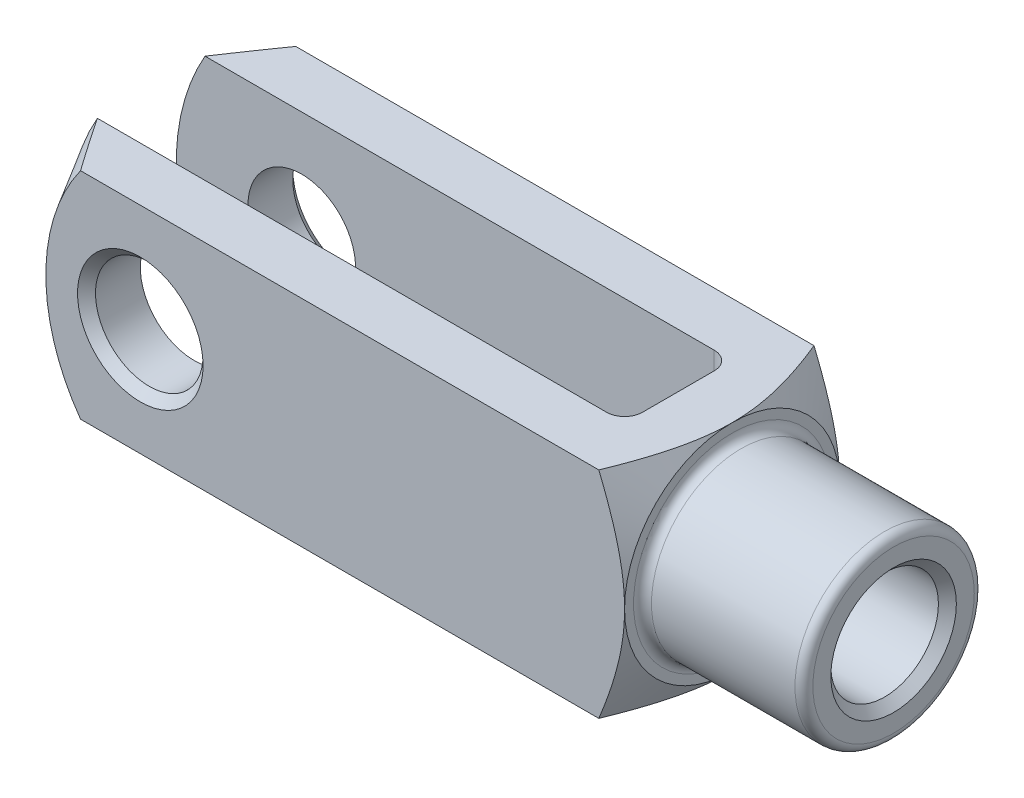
ISO-10303-21;
HEADER;
FILE_DESCRIPTION(('STEP AP214'),'2;1');
FILE_NAME('part.step','',(''),(''),'','','');
FILE_SCHEMA(('AUTOMOTIVE_DESIGN { 1 0 10303 214 1 1 1 1 }'));
ENDSEC;
DATA;
#1=APPLICATION_CONTEXT('core data for automotive mechanical design processes');
#2=APPLICATION_PROTOCOL_DEFINITION('international standard','automotive_design',2000,#1);
#3=PRODUCT_CONTEXT('',#1,'mechanical');
#4=PRODUCT('Part','Part','',(#3));
#5=PRODUCT_RELATED_PRODUCT_CATEGORY('part','',(#4));
#6=PRODUCT_DEFINITION_FORMATION('','',#4);
#7=PRODUCT_DEFINITION_CONTEXT('part definition',#1,'design');
#8=PRODUCT_DEFINITION('design','',#6,#7);
#9=PRODUCT_DEFINITION_SHAPE('','',#8);
#10=(LENGTH_UNIT() NAMED_UNIT(*) SI_UNIT(.MILLI.,.METRE.));
#11=(NAMED_UNIT(*) PLANE_ANGLE_UNIT() SI_UNIT($,.RADIAN.));
#12=(NAMED_UNIT(*) SI_UNIT($,.STERADIAN.) SOLID_ANGLE_UNIT());
#13=UNCERTAINTY_MEASURE_WITH_UNIT(LENGTH_MEASURE(1.E-05),#10,'distance_accuracy_value','');
#14=(GEOMETRIC_REPRESENTATION_CONTEXT(3) GLOBAL_UNCERTAINTY_ASSIGNED_CONTEXT((#13)) GLOBAL_UNIT_ASSIGNED_CONTEXT((#10,
#11,#12)) REPRESENTATION_CONTEXT('',''));
#15=CARTESIAN_POINT('',(0.,0.,0.));
#16=DIRECTION('',(0.,0.,1.));
#17=DIRECTION('',(1.,0.,0.));
#18=AXIS2_PLACEMENT_3D('',#15,#16,#17);
#19=CARTESIAN_POINT('',(-13.,-6.,-1.99999999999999));
#20=DIRECTION('',(0.,-1.,0.));
#21=DIRECTION('',(0.,0.,-1.));
#22=AXIS2_PLACEMENT_3D('',#19,#20,#21);
#23=CYLINDRICAL_SURFACE('',#22,1.);
#24=DIRECTION('',(0.,1.,0.));
#25=VECTOR('',#24,1.);
#26=CARTESIAN_POINT('',(-12.,-6.,-1.99999999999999));
#27=LINE('',#26,#25);
#28=CARTESIAN_POINT('',(-12.,-2.2360679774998,-1.99999999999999));
#29=VERTEX_POINT('',#28);
#30=CARTESIAN_POINT('',(-12.,-6.,-1.99999999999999));
#31=VERTEX_POINT('',#30);
#32=EDGE_CURVE('E359',#29,#31,#27,.F.);
#33=ORIENTED_EDGE('',*,*,#32,.F.);
#34=CARTESIAN_POINT('',(-12.,-2.2360679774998,-1.99999999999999));
#35=CARTESIAN_POINT('',(-12.0000045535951,-2.20775625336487,-2.0316590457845));
#36=CARTESIAN_POINT('',(-12.0015027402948,-2.17878644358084,-2.06268973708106));
#37=CARTESIAN_POINT('',(-12.0071675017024,-2.11972302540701,-2.12333658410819));
#38=CARTESIAN_POINT('',(-12.0113306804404,-2.08963089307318,-2.15295448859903));
#39=CARTESIAN_POINT('',(-12.0272653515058,-1.99831552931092,-2.23913028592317));
#40=CARTESIAN_POINT('',(-12.042491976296,-1.9356165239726,-2.29349671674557));
#41=CARTESIAN_POINT('',(-12.0924353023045,-1.76515041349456,-2.42955659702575));
#42=CARTESIAN_POINT('',(-12.1333844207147,-1.65483793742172,-2.50573620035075));
#43=CARTESIAN_POINT('',(-12.2281810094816,-1.42878588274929,-2.64123043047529));
#44=CARTESIAN_POINT('',(-12.2821091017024,-1.31301617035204,-2.70043436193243));
#45=CARTESIAN_POINT('',(-12.3826407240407,-1.10989755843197,-2.78870645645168));
#46=CARTESIAN_POINT('',(-12.4273457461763,-1.02322848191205,-2.82159960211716));
#47=CARTESIAN_POINT('',(-12.51989509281,-0.848750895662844,-2.87889978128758));
#48=CARTESIAN_POINT('',(-12.5677411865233,-0.760941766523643,-2.90330198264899));
#49=CARTESIAN_POINT('',(-12.7141236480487,-0.496880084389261,-2.96406270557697));
#50=CARTESIAN_POINT('',(-12.8158260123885,-0.319369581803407,-2.98823962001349));
#51=CARTESIAN_POINT('',(-12.9435558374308,-0.0977711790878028,-2.99873153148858));
#52=CARTESIAN_POINT('',(-12.9690355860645,-0.0536324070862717,-2.99984541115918));
#53=CARTESIAN_POINT('',(-12.9963484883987,-0.0063245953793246,-2.99999499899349));
#54=CARTESIAN_POINT('',(-12.9981742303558,-0.00316231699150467,-2.99999999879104));
#55=CARTESIAN_POINT('',(-13.,0.,-2.99999999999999));
#56=B_SPLINE_CURVE_WITH_KNOTS('',3,(#34,#35,#36,#37,#38,#39,#40,#41,#42,#43,#44,#45,#46,#47,#48,
#49,#50,#51,#52,#53,#54,#55),.UNSPECIFIED.,.F.,.F.,(4,2,2,2,2,2,2,2,2,2,4),(0.,
0.127332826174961,0.254503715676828,0.506902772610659,0.92513076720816,1.34602696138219,
1.65435422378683,1.96285666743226,2.57763836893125,2.73056489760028,2.74151935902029),.UNSPECIFIED.);
#57=CARTESIAN_POINT('',(-13.,0.,-2.99999999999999));
#58=VERTEX_POINT('',#57);
#59=EDGE_CURVE('E390',#29,#58,#56,.T.);
#60=ORIENTED_EDGE('',*,*,#59,.T.);
#61=DIRECTION('',(0.,1.,0.));
#62=VECTOR('',#61,1.);
#63=CARTESIAN_POINT('',(-13.,6.,-2.99999999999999));
#64=LINE('',#63,#62);
#65=CARTESIAN_POINT('',(-13.,-6.,-2.99999999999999));
#66=VERTEX_POINT('',#65);
#67=EDGE_CURVE('E183',#66,#58,#64,.T.);
#68=ORIENTED_EDGE('',*,*,#67,.F.);
#69=CARTESIAN_POINT('',(-13.,-6.,-1.99999999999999));
#70=DIRECTION('',(0.,-1.,0.));
#71=DIRECTION('',(0.,0.,-1.));
#72=AXIS2_PLACEMENT_3D('',#69,#70,#71);
#73=CIRCLE('',#72,1.);
#74=EDGE_CURVE('E198',#31,#66,#73,.F.);
#75=ORIENTED_EDGE('',*,*,#74,.F.);
#76=EDGE_LOOP('',(#33,#60,#68,#75));
#77=FACE_BOUND('',#76,.T.);
#78=ADVANCED_FACE('F37',(#77),#23,.F.);
#79=CARTESIAN_POINT('',(-12.,-6.,-2.99999999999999));
#80=DIRECTION('',(1.,0.,0.));
#81=DIRECTION('',(0.,0.,-1.));
#82=AXIS2_PLACEMENT_3D('',#79,#80,#81);
#83=PLANE('',#82);
#84=CARTESIAN_POINT('',(-12.,6.,-1.99999999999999));
#85=VERTEX_POINT('',#84);
#86=CARTESIAN_POINT('',(-12.,2.2360679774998,-1.99999999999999));
#87=VERTEX_POINT('',#86);
#88=EDGE_CURVE('E375',#85,#87,#27,.F.);
#89=ORIENTED_EDGE('',*,*,#88,.T.);
#90=CARTESIAN_POINT('',(-12.,0.,0.));
#91=DIRECTION('',(1.,0.,0.));
#92=DIRECTION('',(0.,0.,-1.));
#93=AXIS2_PLACEMENT_3D('',#90,#91,#92);
#94=CIRCLE('',#93,3.);
#95=CARTESIAN_POINT('',(-12.,2.2360679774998,1.99999999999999));
#96=VERTEX_POINT('',#95);
#97=EDGE_CURVE('E421',#87,#96,#94,.T.);
#98=ORIENTED_EDGE('',*,*,#97,.T.);
#99=DIRECTION('',(0.,1.,0.));
#100=VECTOR('',#99,1.);
#101=CARTESIAN_POINT('',(-12.,6.,1.99999999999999));
#102=LINE('',#101,#100);
#103=CARTESIAN_POINT('',(-12.,6.,1.99999999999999));
#104=VERTEX_POINT('',#103);
#105=EDGE_CURVE('E160',#96,#104,#102,.T.);
#106=ORIENTED_EDGE('',*,*,#105,.T.);
#107=DIRECTION('',(0.,0.,-1.));
#108=VECTOR('',#107,1.);
#109=CARTESIAN_POINT('',(-12.,6.,-2.99999999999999));
#110=LINE('',#109,#108);
#111=EDGE_CURVE('E339',#104,#85,#110,.T.);
#112=ORIENTED_EDGE('',*,*,#111,.T.);
#113=EDGE_LOOP('',(#89,#98,#106,#112));
#114=FACE_BOUND('',#113,.T.);
#115=ADVANCED_FACE('F441',(#114),#83,.F.);
#116=CARTESIAN_POINT('',(-13.,-6.,1.99999999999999));
#117=DIRECTION('',(0.,-1.,0.));
#118=DIRECTION('',(0.,0.,-1.));
#119=AXIS2_PLACEMENT_3D('',#116,#117,#118);
#120=CYLINDRICAL_SURFACE('',#119,1.);
#121=ORIENTED_EDGE('',*,*,#105,.F.);
#122=CARTESIAN_POINT('',(-12.,2.2360679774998,1.99999999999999));
#123=CARTESIAN_POINT('',(-12.0000045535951,2.20775625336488,2.0316590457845));
#124=CARTESIAN_POINT('',(-12.0015027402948,2.17878644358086,2.06268973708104));
#125=CARTESIAN_POINT('',(-12.0071675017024,2.11972302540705,2.12333658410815));
#126=CARTESIAN_POINT('',(-12.0113306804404,2.08963089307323,2.15295448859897));
#127=CARTESIAN_POINT('',(-12.0272653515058,1.99831552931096,2.23913028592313));
#128=CARTESIAN_POINT('',(-12.042491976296,1.93561652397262,2.29349671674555));
#129=CARTESIAN_POINT('',(-12.0924353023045,1.76515041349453,2.42955659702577));
#130=CARTESIAN_POINT('',(-12.1333844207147,1.65483793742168,2.50573620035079));
#131=CARTESIAN_POINT('',(-12.2281810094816,1.42878588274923,2.64123043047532));
#132=CARTESIAN_POINT('',(-12.2821091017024,1.31301617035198,2.70043436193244));
#133=CARTESIAN_POINT('',(-12.3826407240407,1.10989755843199,2.78870645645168));
#134=CARTESIAN_POINT('',(-12.4273457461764,1.0232284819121,2.82159960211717));
#135=CARTESIAN_POINT('',(-12.5198950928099,0.848750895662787,2.87889978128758));
#136=CARTESIAN_POINT('',(-12.5677411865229,0.760941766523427,2.90330198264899));
#137=CARTESIAN_POINT('',(-12.7141236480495,0.496880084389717,2.96406270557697));
#138=CARTESIAN_POINT('',(-12.8158260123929,0.319369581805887,2.9882396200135));
#139=CARTESIAN_POINT('',(-12.9435558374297,0.0977711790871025,2.99873153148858));
#140=CARTESIAN_POINT('',(-12.9690355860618,0.0536324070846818,2.99984541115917));
#141=CARTESIAN_POINT('',(-12.9963484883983,0.00632459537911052,2.99999499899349));
#142=CARTESIAN_POINT('',(-12.9981742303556,0.00316231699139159,2.99999999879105));
#143=CARTESIAN_POINT('',(-13.,0.,3.));
#144=B_SPLINE_CURVE_WITH_KNOTS('',3,(#122,#123,#124,#125,#126,#127,#128,#129,#130,#131,#132,
#133,#134,#135,#136,#137,#138,#139,#140,#141,#142,#143),.UNSPECIFIED.,.F.,.F.,(4,2,2,2,2,2,2,2,
2,2,4),(0.,0.127332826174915,0.254503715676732,0.506902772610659,0.925130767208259,
1.34602696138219,1.65435422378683,1.96285666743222,2.57763836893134,2.73056489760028,
2.74151935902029),.UNSPECIFIED.);
#145=CARTESIAN_POINT('',(-13.,0.,3.));
#146=VERTEX_POINT('',#145);
#147=EDGE_CURVE('E145',#96,#146,#144,.T.);
#148=ORIENTED_EDGE('',*,*,#147,.T.);
#149=DIRECTION('',(0.,1.,0.));
#150=VECTOR('',#149,1.);
#151=CARTESIAN_POINT('',(-13.,-6.,2.99999999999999));
#152=LINE('',#151,#150);
#153=CARTESIAN_POINT('',(-13.,6.,2.99999999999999));
#154=VERTEX_POINT('',#153);
#155=EDGE_CURVE('E159',#154,#146,#152,.F.);
#156=ORIENTED_EDGE('',*,*,#155,.F.);
#157=CARTESIAN_POINT('',(-13.,6.,1.99999999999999));
#158=DIRECTION('',(0.,1.,0.));
#159=DIRECTION('',(0.,0.,1.));
#160=AXIS2_PLACEMENT_3D('',#157,#158,#159);
#161=CIRCLE('',#160,1.);
#162=EDGE_CURVE('E190',#104,#154,#161,.F.);
#163=ORIENTED_EDGE('',*,*,#162,.F.);
#164=EDGE_LOOP('',(#121,#148,#156,#163));
#165=FACE_BOUND('',#164,.T.);
#166=ADVANCED_FACE('F156',(#165),#120,.F.);
#167=CARTESIAN_POINT('',(-43.,-6.,-3.));
#168=DIRECTION('',(0.,0.,-1.));
#169=DIRECTION('',(-1.,0.,0.));
#170=AXIS2_PLACEMENT_3D('',#167,#168,#169);
#171=PLANE('',#170);
#172=CARTESIAN_POINT('',(-36.,0.,-2.99999999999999));
#173=DIRECTION('',(0.,0.,-1.));
#174=DIRECTION('',(-1.,0.,0.));
#175=AXIS2_PLACEMENT_3D('',#172,#173,#174);
#176=CIRCLE('',#175,3.);
#177=CARTESIAN_POINT('',(-39.,0.,-3.));
#178=VERTEX_POINT('',#177);
#179=EDGE_CURVE('E369',#178,#178,#176,.F.);
#180=ORIENTED_EDGE('',*,*,#179,.F.);
#181=EDGE_LOOP('',(#180));
#182=FACE_BOUND('',#181,.T.);
#183=CARTESIAN_POINT('',(-31.,0.,-3.));
#184=DIRECTION('',(0.,0.,1.));
#185=DIRECTION('',(1.,0.,0.));
#186=AXIS2_PLACEMENT_3D('',#183,#184,#185);
#187=CIRCLE('',#186,12.);
#188=CARTESIAN_POINT('',(-41.3923048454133,6.,-3.));
#189=VERTEX_POINT('',#188);
#190=CARTESIAN_POINT('',(-41.3923048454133,-6.,-3.));
#191=VERTEX_POINT('',#190);
#192=EDGE_CURVE('E277',#189,#191,#187,.T.);
#193=ORIENTED_EDGE('',*,*,#192,.T.);
#194=DIRECTION('',(-1.,0.,0.));
#195=VECTOR('',#194,1.);
#196=CARTESIAN_POINT('',(-43.,-6.,-3.));
#197=LINE('',#196,#195);
#198=EDGE_CURVE('E334',#66,#191,#197,.T.);
#199=ORIENTED_EDGE('',*,*,#198,.F.);
#200=ORIENTED_EDGE('',*,*,#67,.T.);
#201=CARTESIAN_POINT('',(-13.,6.,-2.99999999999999));
#202=VERTEX_POINT('',#201);
#203=EDGE_CURVE('E179',#58,#202,#64,.T.);
#204=ORIENTED_EDGE('',*,*,#203,.T.);
#205=DIRECTION('',(-1.,0.,0.));
#206=VECTOR('',#205,1.);
#207=CARTESIAN_POINT('',(-43.,6.,-3.));
#208=LINE('',#207,#206);
#209=EDGE_CURVE('E347',#202,#189,#208,.T.);
#210=ORIENTED_EDGE('',*,*,#209,.T.);
#211=EDGE_LOOP('',(#193,#199,#200,#204,#210));
#212=FACE_BOUND('',#211,.T.);
#213=ADVANCED_FACE('F393',(#182,#212),#171,.F.);
#214=CARTESIAN_POINT('',(-43.,-6.,3.00000000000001));
#215=DIRECTION('',(0.,0.,1.));
#216=DIRECTION('',(1.,0.,0.));
#217=AXIS2_PLACEMENT_3D('',#214,#215,#216);
#218=PLANE('',#217);
#219=CARTESIAN_POINT('',(-36.,0.,3.));
#220=DIRECTION('',(0.,0.,1.));
#221=DIRECTION('',(1.,0.,0.));
#222=AXIS2_PLACEMENT_3D('',#219,#220,#221);
#223=CIRCLE('',#222,3.);
#224=CARTESIAN_POINT('',(-33.,0.,3.));
#225=VERTEX_POINT('',#224);
#226=EDGE_CURVE('E346',#225,#225,#223,.F.);
#227=ORIENTED_EDGE('',*,*,#226,.F.);
#228=EDGE_LOOP('',(#227));
#229=FACE_BOUND('',#228,.T.);
#230=DIRECTION('',(1.,0.,0.));
#231=VECTOR('',#230,1.);
#232=CARTESIAN_POINT('',(-43.,-6.,3.00000000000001));
#233=LINE('',#232,#231);
#234=CARTESIAN_POINT('',(-41.3923048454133,-6.,3.00000000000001));
#235=VERTEX_POINT('',#234);
#236=CARTESIAN_POINT('',(-13.,-6.,2.99999999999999));
#237=VERTEX_POINT('',#236);
#238=EDGE_CURVE('E338',#235,#237,#233,.T.);
#239=ORIENTED_EDGE('',*,*,#238,.F.);
#240=CARTESIAN_POINT('',(-31.,0.,3.00000000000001));
#241=DIRECTION('',(0.,0.,1.));
#242=DIRECTION('',(1.,0.,0.));
#243=AXIS2_PLACEMENT_3D('',#240,#241,#242);
#244=CIRCLE('',#243,12.);
#245=CARTESIAN_POINT('',(-41.3923048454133,6.,3.00000000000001));
#246=VERTEX_POINT('',#245);
#247=EDGE_CURVE('E425',#246,#235,#244,.T.);
#248=ORIENTED_EDGE('',*,*,#247,.F.);
#249=DIRECTION('',(1.,0.,0.));
#250=VECTOR('',#249,1.);
#251=CARTESIAN_POINT('',(-43.,6.,3.00000000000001));
#252=LINE('',#251,#250);
#253=EDGE_CURVE('E176',#246,#154,#252,.T.);
#254=ORIENTED_EDGE('',*,*,#253,.T.);
#255=ORIENTED_EDGE('',*,*,#155,.T.);
#256=EDGE_CURVE('E164',#146,#237,#152,.F.);
#257=ORIENTED_EDGE('',*,*,#256,.T.);
#258=EDGE_LOOP('',(#239,#248,#254,#255,#257));
#259=FACE_BOUND('',#258,.T.);
#260=ADVANCED_FACE('F173',(#229,#259),#218,.F.);
#261=CARTESIAN_POINT('',(-43.,-6.,6.));
#262=DIRECTION('',(0.,0.,1.));
#263=DIRECTION('',(1.,0.,0.));
#264=AXIS2_PLACEMENT_3D('',#261,#262,#263);
#265=PLANE('',#264);
#266=CARTESIAN_POINT('',(-36.,0.,6.));
#267=DIRECTION('',(0.,0.,1.));
#268=DIRECTION('',(1.,0.,0.));
#269=AXIS2_PLACEMENT_3D('',#266,#267,#268);
#270=CIRCLE('',#269,3.5);
#271=CARTESIAN_POINT('',(-32.5,0.,6.));
#272=VERTEX_POINT('',#271);
#273=EDGE_CURVE('E229',#272,#272,#270,.F.);
#274=ORIENTED_EDGE('',*,*,#273,.T.);
#275=EDGE_LOOP('',(#274));
#276=FACE_BOUND('',#275,.T.);
#277=DIRECTION('',(1.,0.,0.));
#278=VECTOR('',#277,1.);
#279=CARTESIAN_POINT('',(-43.,6.,6.));
#280=LINE('',#279,#278);
#281=CARTESIAN_POINT('',(-39.3325134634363,6.,6.));
#282=VERTEX_POINT('',#281);
#283=CARTESIAN_POINT('',(-10.4348778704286,6.,6.));
#284=VERTEX_POINT('',#283);
#285=EDGE_CURVE('E366',#282,#284,#280,.T.);
#286=ORIENTED_EDGE('',*,*,#285,.F.);
#287=CARTESIAN_POINT('',(-31.,0.,6.));
#288=DIRECTION('',(0.,0.,1.));
#289=DIRECTION('',(1.,0.,0.));
#290=AXIS2_PLACEMENT_3D('',#287,#288,#289);
#291=CIRCLE('',#290,10.2679491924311);
#292=CARTESIAN_POINT('',(-39.3325134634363,-6.,6.));
#293=VERTEX_POINT('',#292);
#294=EDGE_CURVE('E61',#282,#293,#291,.T.);
#295=ORIENTED_EDGE('',*,*,#294,.T.);
#296=DIRECTION('',(1.,0.,0.));
#297=VECTOR('',#296,1.);
#298=CARTESIAN_POINT('',(-43.,-6.,6.));
#299=LINE('',#298,#297);
#300=CARTESIAN_POINT('',(-10.4348778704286,-6.,6.));
#301=VERTEX_POINT('',#300);
#302=EDGE_CURVE('E363',#293,#301,#299,.T.);
#303=ORIENTED_EDGE('',*,*,#302,.T.);
#304=CARTESIAN_POINT('',(-13.4135240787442,-12.2544261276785,6.));
#305=CARTESIAN_POINT('',(-13.260207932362,-11.9587102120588,6.));
#306=CARTESIAN_POINT('',(-13.1077023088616,-11.6625701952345,6.));
#307=CARTESIAN_POINT('',(-12.8047419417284,-11.0692236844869,6.));
#308=CARTESIAN_POINT('',(-12.6542873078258,-10.7720171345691,6.));
#309=CARTESIAN_POINT('',(-12.3556153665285,-10.1758321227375,6.));
#310=CARTESIAN_POINT('',(-12.2074024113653,-9.87685147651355,6.));
#311=CARTESIAN_POINT('',(-11.9140958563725,-9.27736809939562,6.));
#312=CARTESIAN_POINT('',(-11.7690022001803,-8.97686539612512,6.));
#313=CARTESIAN_POINT('',(-11.4739226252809,-8.35545095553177,6.));
#314=CARTESIAN_POINT('',(-11.3241849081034,-8.03442101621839,6.));
#315=CARTESIAN_POINT('',(-11.0304086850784,-7.3897325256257,6.));
#316=CARTESIAN_POINT('',(-10.886370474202,-7.06607383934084,6.));
#317=CARTESIAN_POINT('',(-10.6058683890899,-6.41564861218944,6.));
#318=CARTESIAN_POINT('',(-10.4694011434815,-6.0888835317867,6.));
#319=CARTESIAN_POINT('',(-10.2064860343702,-5.43134466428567,6.));
#320=CARTESIAN_POINT('',(-10.0800369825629,-5.10057135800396,6.));
#321=CARTESIAN_POINT('',(-9.88755181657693,-4.56461982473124,6.));
#322=CARTESIAN_POINT('',(-9.81724725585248,-4.36097670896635,6.));
#323=CARTESIAN_POINT('',(-9.68269100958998,-3.95170680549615,6.));
#324=CARTESIAN_POINT('',(-9.61843880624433,-3.74608018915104,6.));
#325=CARTESIAN_POINT('',(-9.49717598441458,-3.33269266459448,6.));
#326=CARTESIAN_POINT('',(-9.44016521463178,-3.12493180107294,6.));
#327=CARTESIAN_POINT('',(-9.3347478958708,-2.70722081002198,6.));
#328=CARTESIAN_POINT('',(-9.28634125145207,-2.49727070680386,6.));
#329=CARTESIAN_POINT('',(-9.20060957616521,-2.08023423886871,6.));
#330=CARTESIAN_POINT('',(-9.16305108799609,-1.8731963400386,6.));
#331=CARTESIAN_POINT('',(-9.098854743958,-1.45741996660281,6.));
#332=CARTESIAN_POINT('',(-9.07221653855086,-1.24868154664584,6.));
#333=CARTESIAN_POINT('',(-9.03097423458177,-0.830141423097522,6.));
#334=CARTESIAN_POINT('',(-9.01636227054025,-0.620340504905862,6.));
#335=CARTESIAN_POINT('',(-8.99981707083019,-0.200237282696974,6.));
#336=CARTESIAN_POINT('',(-8.99788339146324,0.0100650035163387,6.));
#337=CARTESIAN_POINT('',(-9.00645771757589,0.415074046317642,6.));
#338=CARTESIAN_POINT('',(-9.01606940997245,0.609800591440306,6.));
#339=CARTESIAN_POINT('',(-9.04587321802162,0.998433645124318,6.));
#340=CARTESIAN_POINT('',(-9.06606530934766,1.19234015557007,6.));
#341=CARTESIAN_POINT('',(-9.11628968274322,1.57896183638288,6.));
#342=CARTESIAN_POINT('',(-9.14632704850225,1.77167633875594,6.));
#343=CARTESIAN_POINT('',(-9.2152516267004,2.1555059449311,6.));
#344=CARTESIAN_POINT('',(-9.25413908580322,2.34662100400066,6.));
#345=CARTESIAN_POINT('',(-9.34092007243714,2.73259717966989,6.));
#346=CARTESIAN_POINT('',(-9.38904169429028,2.92740661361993,6.));
#347=CARTESIAN_POINT('',(-9.49234908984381,3.31513101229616,6.));
#348=CARTESIAN_POINT('',(-9.5475349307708,3.50804595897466,6.));
#349=CARTESIAN_POINT('',(-9.66390260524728,3.89203886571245,6.));
#350=CARTESIAN_POINT('',(-9.72508417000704,4.0831169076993,6.));
#351=CARTESIAN_POINT('',(-9.85250790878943,4.46355855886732,6.));
#352=CARTESIAN_POINT('',(-9.91874981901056,4.65292225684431,6.));
#353=CARTESIAN_POINT('',(-10.0610705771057,5.04546937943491,6.));
#354=CARTESIAN_POINT('',(-10.1375111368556,5.24852125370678,6.));
#355=CARTESIAN_POINT('',(-10.2945475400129,5.65301574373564,6.));
#356=CARTESIAN_POINT('',(-10.3751435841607,5.85445828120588,6.));
#357=CARTESIAN_POINT('',(-10.6221320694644,6.45674423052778,6.));
#358=CARTESIAN_POINT('',(-10.7936954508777,6.85546660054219,6.));
#359=CARTESIAN_POINT('',(-11.1466594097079,7.64890048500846,6.));
#360=CARTESIAN_POINT('',(-11.3280684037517,8.04360821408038,6.));
#361=CARTESIAN_POINT('',(-11.6979069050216,8.82965921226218,6.));
#362=CARTESIAN_POINT('',(-11.886335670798,9.221002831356,6.));
#363=CARTESIAN_POINT('',(-12.2689881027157,10.0023172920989,6.));
#364=CARTESIAN_POINT('',(-12.463227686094,10.3922803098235,6.));
#365=CARTESIAN_POINT('',(-12.8556839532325,11.1702067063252,6.));
#366=CARTESIAN_POINT('',(-13.053900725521,11.5581700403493,6.));
#367=CARTESIAN_POINT('',(-13.4533033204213,12.332317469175,6.));
#368=CARTESIAN_POINT('',(-13.6544876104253,12.718502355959,6.));
#369=CARTESIAN_POINT('',(-14.0592727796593,13.4896043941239,6.));
#370=CARTESIAN_POINT('',(-14.2628736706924,13.8745215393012,6.));
#371=CARTESIAN_POINT('',(-14.8157959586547,14.9135601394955,6.));
#372=CARTESIAN_POINT('',(-15.1669414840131,15.5667104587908,6.));
#373=CARTESIAN_POINT('',(-15.8731950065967,16.8709801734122,6.));
#374=CARTESIAN_POINT('',(-16.2283035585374,17.522099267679,6.));
#375=CARTESIAN_POINT('',(-16.9393356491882,18.8190448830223,6.));
#376=CARTESIAN_POINT('',(-17.2952428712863,19.4648803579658,6.));
#377=CARTESIAN_POINT('',(-18.0091689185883,20.755250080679,6.));
#378=CARTESIAN_POINT('',(-18.3671874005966,21.3997845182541,6.));
#379=CARTESIAN_POINT('',(-18.725961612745,22.0438949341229,6.));
#380=B_SPLINE_CURVE_WITH_KNOTS('',3,(#304,#305,#306,#307,#308,#309,#310,#311,#312,#313,#314,
#315,#316,#317,#318,#319,#320,#321,#322,#323,#324,#325,#326,#327,#328,#329,#330,#331,#332,#333,
#334,#335,#336,#337,#338,#339,#340,#341,#342,#343,#344,#345,#346,#347,#348,#349,#350,#351,#352,
#353,#354,#355,#356,#357,#358,#359,#360,#361,#362,#363,#364,#365,#366,#367,#368,#369,#370,#371,
#372,#373,#374,#375,#376,#377,#378,#379),.UNSPECIFIED.,.F.,.F.,(4,2,2,2,2,2,2,2,2,2,2,2,2,2,2,2,
2,2,2,2,2,2,2,2,2,2,2,2,2,2,2,2,2,2,2,2,2,4),(0.,0.999295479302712,1.99864421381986,
2.99973317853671,4.00080403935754,5.06346356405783,6.12617801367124,7.18841537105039,
8.2505265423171,8.89676374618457,9.54294561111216,10.1891139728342,10.8352751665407,
11.4662683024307,12.0972412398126,12.7278011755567,13.3583390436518,13.9429319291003,
14.5275234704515,15.1124173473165,15.6973275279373,16.2991674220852,16.9010130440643,
17.5028316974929,18.1046189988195,18.7554539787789,19.4063204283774,20.7083071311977,
22.0114249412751,23.3144055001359,24.6213589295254,25.9283414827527,27.2346711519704,
28.5410072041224,30.7656602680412,32.9906287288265,35.2028538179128,37.4147287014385),.UNSPECIFIED.);
#381=CARTESIAN_POINT('',(-9.,0.,6.));
#382=VERTEX_POINT('',#381);
#383=EDGE_CURVE('E306',#382,#301,#380,.F.);
#384=ORIENTED_EDGE('',*,*,#383,.F.);
#385=EDGE_CURVE('E304',#284,#382,#380,.F.);
#386=ORIENTED_EDGE('',*,*,#385,.F.);
#387=EDGE_LOOP('',(#286,#295,#303,#384,#386));
#388=FACE_BOUND('',#387,.T.);
#389=ADVANCED_FACE('F288',(#276,#388),#265,.T.);
#390=CARTESIAN_POINT('',(-43.,-6.,6.));
#391=DIRECTION('',(0.,-1.,0.));
#392=DIRECTION('',(0.,0.,-1.));
#393=AXIS2_PLACEMENT_3D('',#390,#391,#392);
#394=PLANE('',#393);
#395=ORIENTED_EDGE('',*,*,#198,.T.);
#396=CARTESIAN_POINT('',(-46.1393635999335,-6.,4.42179012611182));
#397=CARTESIAN_POINT('',(-45.8474254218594,-6.,3.95174312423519));
#398=CARTESIAN_POINT('',(-45.5546877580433,-6.,3.48219040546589));
#399=CARTESIAN_POINT('',(-44.9672392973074,-6.,2.54430803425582));
#400=CARTESIAN_POINT('',(-44.6725284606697,-6.,2.0759784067));
#401=CARTESIAN_POINT('',(-44.0804179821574,-6.,1.14023742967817));
#402=CARTESIAN_POINT('',(-43.7830155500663,-6.,0.672827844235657));
#403=CARTESIAN_POINT('',(-43.1853697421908,-6.,-0.260167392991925));
#404=CARTESIAN_POINT('',(-42.8851263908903,-6.,-0.725753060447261));
#405=CARTESIAN_POINT('',(-42.2685694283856,-6.,-1.67399892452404));
#406=CARTESIAN_POINT('',(-41.9521073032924,-6.,-2.1565626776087));
#407=CARTESIAN_POINT('',(-41.3144057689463,-6.,-3.11852313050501));
#408=CARTESIAN_POINT('',(-40.9931664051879,-6.,-3.59791986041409));
#409=CARTESIAN_POINT('',(-40.3447668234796,-6.,-4.55217998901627));
#410=CARTESIAN_POINT('',(-40.0176111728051,-6.,-5.02704648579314));
#411=CARTESIAN_POINT('',(-39.3552026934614,-6.,-5.97109163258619));
#412=CARTESIAN_POINT('',(-39.0199503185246,-6.,-6.44027059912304));
#413=CARTESIAN_POINT('',(-38.5103377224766,-6.,-7.13578360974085));
#414=CARTESIAN_POINT('',(-38.3401620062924,-6.,-7.36518347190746));
#415=CARTESIAN_POINT('',(-37.9965727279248,-6.,-7.82154235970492));
#416=CARTESIAN_POINT('',(-37.823159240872,-6.,-8.0485014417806));
#417=CARTESIAN_POINT('',(-37.4722215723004,-6.,-8.49973386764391));
#418=CARTESIAN_POINT('',(-37.2946919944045,-6.,-8.72400302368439));
#419=CARTESIAN_POINT('',(-36.9349539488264,-6.,-9.16874891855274));
#420=CARTESIAN_POINT('',(-36.7527457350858,-6.,-9.38922586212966));
#421=CARTESIAN_POINT('',(-36.3845109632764,-6.,-9.82306394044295));
#422=CARTESIAN_POINT('',(-36.1985436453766,-6.,-10.0364751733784));
#423=CARTESIAN_POINT('',(-35.8195986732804,-6.,-10.4571181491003));
#424=CARTESIAN_POINT('',(-35.6266192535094,-6.,-10.6643483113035));
#425=CARTESIAN_POINT('',(-35.2323728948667,-6.,-11.0699097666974));
#426=CARTESIAN_POINT('',(-35.0311255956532,-6.,-11.2682600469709));
#427=CARTESIAN_POINT('',(-34.6177115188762,-6.,-11.6531576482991));
#428=CARTESIAN_POINT('',(-34.4055521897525,-6.,-11.8397128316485));
#429=CARTESIAN_POINT('',(-34.0729884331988,-6.,-12.1098556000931));
#430=CARTESIAN_POINT('',(-33.9576788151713,-6.,-12.1997112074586));
#431=CARTESIAN_POINT('',(-33.7228111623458,-6.,-12.3737716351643));
#432=CARTESIAN_POINT('',(-33.603252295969,-6.,-12.4579753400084));
#433=CARTESIAN_POINT('',(-33.3595319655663,-6.,-12.6192969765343));
#434=CARTESIAN_POINT('',(-33.2353742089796,-6.,-12.6964204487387));
#435=CARTESIAN_POINT('',(-32.982078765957,-6.,-12.8418949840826));
#436=CARTESIAN_POINT('',(-32.8529423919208,-6.,-12.9102483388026));
#437=CARTESIAN_POINT('',(-32.5176686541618,-6.,-13.0703365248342));
#438=CARTESIAN_POINT('',(-32.3077768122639,-6.,-13.1546285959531));
#439=CARTESIAN_POINT('',(-31.9849826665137,-6.,-13.2547999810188));
#440=CARTESIAN_POINT('',(-31.876088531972,-6.,-13.2838084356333));
#441=CARTESIAN_POINT('',(-31.6561770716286,-6.,-13.3320457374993));
#442=CARTESIAN_POINT('',(-31.5451609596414,-6.,-13.3512800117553));
#443=CARTESIAN_POINT('',(-31.3206486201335,-6.,-13.3793003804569));
#444=CARTESIAN_POINT('',(-31.2071386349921,-6.,-13.3879773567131));
#445=CARTESIAN_POINT('',(-30.9798158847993,-6.,-13.394110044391));
#446=CARTESIAN_POINT('',(-30.8660031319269,-6.,-13.3915662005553));
#447=CARTESIAN_POINT('',(-30.6391561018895,-6.,-13.3753792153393));
#448=CARTESIAN_POINT('',(-30.5261219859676,-6.,-13.361733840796));
#449=CARTESIAN_POINT('',(-30.3018245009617,-6.,-13.3239722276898));
#450=CARTESIAN_POINT('',(-30.1905614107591,-6.,-13.2998543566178));
#451=CARTESIAN_POINT('',(-29.9501565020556,-6.,-13.2367814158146));
#452=CARTESIAN_POINT('',(-29.8215207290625,-6.,-13.1959054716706));
#453=CARTESIAN_POINT('',(-29.5684335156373,-6.,-13.1027470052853));
#454=CARTESIAN_POINT('',(-29.443984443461,-6.,-13.0504581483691));
#455=CARTESIAN_POINT('',(-29.1991880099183,-6.,-12.9362481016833));
#456=CARTESIAN_POINT('',(-29.07885370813,-6.,-12.8742991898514));
#457=CARTESIAN_POINT('',(-28.8425871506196,-6.,-12.7426097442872));
#458=CARTESIAN_POINT('',(-28.7266544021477,-6.,-12.6728700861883));
#459=CARTESIAN_POINT('',(-28.4615159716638,-6.,-12.5031033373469));
#460=CARTESIAN_POINT('',(-28.3138719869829,-6.,-12.4006458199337));
#461=CARTESIAN_POINT('',(-28.0249232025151,-6.,-12.1871088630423));
#462=CARTESIAN_POINT('',(-27.8836214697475,-6.,-12.0760253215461));
#463=CARTESIAN_POINT('',(-27.6062884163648,-6.,-11.8469719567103));
#464=CARTESIAN_POINT('',(-27.470267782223,-6.,-11.7289892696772));
#465=CARTESIAN_POINT('',(-27.2030263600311,-6.,-11.4877793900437));
#466=CARTESIAN_POINT('',(-27.0718047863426,-6.,-11.3645530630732));
#467=CARTESIAN_POINT('',(-26.8125971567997,-6.,-11.1130582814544));
#468=CARTESIAN_POINT('',(-26.6846384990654,-6.,-10.9847616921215));
#469=CARTESIAN_POINT('',(-26.4322872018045,-6.,-10.724700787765));
#470=CARTESIAN_POINT('',(-26.3078948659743,-6.,-10.5929361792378));
#471=CARTESIAN_POINT('',(-25.9395885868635,-6.,-10.1936988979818));
#472=CARTESIAN_POINT('',(-25.7002559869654,-6.,-9.92199665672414));
#473=CARTESIAN_POINT('',(-25.2996709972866,-6.,-9.45153467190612));
#474=CARTESIAN_POINT('',(-25.1360902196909,-6.,-9.25473181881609));
#475=CARTESIAN_POINT('',(-24.8127787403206,-6.,-8.85792160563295));
#476=CARTESIAN_POINT('',(-24.6530488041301,-6.,-8.65791362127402));
#477=CARTESIAN_POINT('',(-24.3392735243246,-6.,-8.25842615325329));
#478=CARTESIAN_POINT('',(-24.1851785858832,-6.,-8.05898548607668));
#479=CARTESIAN_POINT('',(-23.8797491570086,-6.,-7.65809556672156));
#480=CARTESIAN_POINT('',(-23.7284138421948,-6.,-7.45664694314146));
#481=CARTESIAN_POINT('',(-23.5782098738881,-6.,-7.25436752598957));
#482=B_SPLINE_CURVE_WITH_KNOTS('',3,(#396,#397,#398,#399,#400,#401,#402,#403,#404,#405,#406,
#407,#408,#409,#410,#411,#412,#413,#414,#415,#416,#417,#418,#419,#420,#421,#422,#423,#424,#425,
#426,#427,#428,#429,#430,#431,#432,#433,#434,#435,#436,#437,#438,#439,#440,#441,#442,#443,#444,
#445,#446,#447,#448,#449,#450,#451,#452,#453,#454,#455,#456,#457,#458,#459,#460,#461,#462,#463,
#464,#465,#466,#467,#468,#469,#470,#471,#472,#473,#474,#475,#476,#477,#478,#479,#480,#481),
.UNSPECIFIED.,.F.,.F.,(4,2,2,2,2,2,2,2,2,2,2,2,2,2,2,2,2,2,2,2,2,2,2,2,2,2,2,2,2,2,2,2,2,2,2,2,
2,2,2,2,2,2,4),(0.,1.65998663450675,3.32000678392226,4.98200894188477,6.64399678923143,
8.3752015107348,10.1063897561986,11.8362942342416,13.5661019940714,14.4229674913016,
15.2798131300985,16.1378539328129,16.9958482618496,17.8449395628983,18.6942461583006,
19.5416403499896,20.3884636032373,20.8268856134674,21.2653939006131,21.7035560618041,
22.1416034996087,22.8173812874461,23.1550908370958,23.4926126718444,23.8335942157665,
24.1745622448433,24.5155988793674,24.8566886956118,25.2609625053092,25.6654612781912,
26.071142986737,26.4767791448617,27.0154896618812,27.554457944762,28.0944653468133,
28.6343839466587,29.1779015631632,29.721465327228,30.8073733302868,31.5750640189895,
32.3429060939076,33.0989888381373,33.8548418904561),.UNSPECIFIED.);
#483=CARTESIAN_POINT('',(-39.3325134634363,-6.,-6.));
#484=VERTEX_POINT('',#483);
#485=EDGE_CURVE('E276',#191,#484,#482,.T.);
#486=ORIENTED_EDGE('',*,*,#485,.T.);
#487=DIRECTION('',(1.,0.,0.));
#488=VECTOR('',#487,1.);
#489=CARTESIAN_POINT('',(-43.,-6.,-6.));
#490=LINE('',#489,#488);
#491=CARTESIAN_POINT('',(-10.4348778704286,-6.,-6.));
#492=VERTEX_POINT('',#491);
#493=EDGE_CURVE('E360',#484,#492,#490,.T.);
#494=ORIENTED_EDGE('',*,*,#493,.T.);
#495=CARTESIAN_POINT('',(-13.4135240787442,-6.,-12.2544261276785));
#496=CARTESIAN_POINT('',(-13.260207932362,-6.,-11.9587102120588));
#497=CARTESIAN_POINT('',(-13.1077023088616,-6.,-11.6625701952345));
#498=CARTESIAN_POINT('',(-12.8047419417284,-6.,-11.0692236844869));
#499=CARTESIAN_POINT('',(-12.6542873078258,-6.,-10.7720171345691));
#500=CARTESIAN_POINT('',(-12.3556153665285,-6.,-10.1758321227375));
#501=CARTESIAN_POINT('',(-12.2074024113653,-6.,-9.87685147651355));
#502=CARTESIAN_POINT('',(-11.9140958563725,-6.,-9.27736809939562));
#503=CARTESIAN_POINT('',(-11.7690022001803,-6.,-8.97686539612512));
#504=CARTESIAN_POINT('',(-11.4739226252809,-6.,-8.35545095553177));
#505=CARTESIAN_POINT('',(-11.3241849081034,-6.,-8.03442101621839));
#506=CARTESIAN_POINT('',(-11.0304086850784,-6.,-7.3897325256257));
#507=CARTESIAN_POINT('',(-10.886370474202,-6.,-7.06607383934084));
#508=CARTESIAN_POINT('',(-10.6058683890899,-6.,-6.41564861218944));
#509=CARTESIAN_POINT('',(-10.4694011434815,-6.,-6.0888835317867));
#510=CARTESIAN_POINT('',(-10.2064860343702,-6.,-5.43134466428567));
#511=CARTESIAN_POINT('',(-10.0800369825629,-6.,-5.10057135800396));
#512=CARTESIAN_POINT('',(-9.88755181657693,-6.,-4.56461982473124));
#513=CARTESIAN_POINT('',(-9.81724725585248,-6.,-4.36097670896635));
#514=CARTESIAN_POINT('',(-9.68269100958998,-6.,-3.95170680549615));
#515=CARTESIAN_POINT('',(-9.61843880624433,-6.,-3.74608018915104));
#516=CARTESIAN_POINT('',(-9.49717598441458,-6.,-3.33269266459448));
#517=CARTESIAN_POINT('',(-9.44016521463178,-6.,-3.12493180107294));
#518=CARTESIAN_POINT('',(-9.3347478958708,-6.,-2.70722081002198));
#519=CARTESIAN_POINT('',(-9.28634125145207,-6.,-2.49727070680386));
#520=CARTESIAN_POINT('',(-9.20060957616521,-6.,-2.08023423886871));
#521=CARTESIAN_POINT('',(-9.16305108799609,-6.,-1.8731963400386));
#522=CARTESIAN_POINT('',(-9.098854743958,-6.,-1.45741996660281));
#523=CARTESIAN_POINT('',(-9.07221653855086,-6.,-1.24868154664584));
#524=CARTESIAN_POINT('',(-9.03097423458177,-6.,-0.830141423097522));
#525=CARTESIAN_POINT('',(-9.01636227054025,-6.,-0.620340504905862));
#526=CARTESIAN_POINT('',(-8.99981707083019,-6.,-0.200237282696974));
#527=CARTESIAN_POINT('',(-8.99788339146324,-6.,0.0100650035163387));
#528=CARTESIAN_POINT('',(-9.00645771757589,-6.,0.415074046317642));
#529=CARTESIAN_POINT('',(-9.01606940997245,-6.,0.609800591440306));
#530=CARTESIAN_POINT('',(-9.04587321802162,-6.,0.998433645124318));
#531=CARTESIAN_POINT('',(-9.06606530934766,-6.,1.19234015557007));
#532=CARTESIAN_POINT('',(-9.11628968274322,-6.,1.57896183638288));
#533=CARTESIAN_POINT('',(-9.14632704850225,-6.,1.77167633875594));
#534=CARTESIAN_POINT('',(-9.2152516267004,-6.,2.1555059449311));
#535=CARTESIAN_POINT('',(-9.25413908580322,-6.,2.34662100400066));
#536=CARTESIAN_POINT('',(-9.34092007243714,-6.,2.73259717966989));
#537=CARTESIAN_POINT('',(-9.38904169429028,-6.,2.92740661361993));
#538=CARTESIAN_POINT('',(-9.49234908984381,-6.,3.31513101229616));
#539=CARTESIAN_POINT('',(-9.5475349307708,-6.,3.50804595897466));
#540=CARTESIAN_POINT('',(-9.66390260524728,-6.,3.89203886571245));
#541=CARTESIAN_POINT('',(-9.72508417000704,-6.,4.0831169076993));
#542=CARTESIAN_POINT('',(-9.85250790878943,-6.,4.46355855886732));
#543=CARTESIAN_POINT('',(-9.91874981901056,-6.,4.65292225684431));
#544=CARTESIAN_POINT('',(-10.0610705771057,-6.,5.04546937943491));
#545=CARTESIAN_POINT('',(-10.1375111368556,-6.,5.24852125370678));
#546=CARTESIAN_POINT('',(-10.2945475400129,-6.,5.65301574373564));
#547=CARTESIAN_POINT('',(-10.3751435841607,-6.,5.85445828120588));
#548=CARTESIAN_POINT('',(-10.6221320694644,-6.,6.45674423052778));
#549=CARTESIAN_POINT('',(-10.7936954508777,-6.,6.85546660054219));
#550=CARTESIAN_POINT('',(-11.1466594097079,-6.,7.64890048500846));
#551=CARTESIAN_POINT('',(-11.3280684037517,-6.,8.04360821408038));
#552=CARTESIAN_POINT('',(-11.6979069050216,-6.,8.82965921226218));
#553=CARTESIAN_POINT('',(-11.886335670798,-6.,9.221002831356));
#554=CARTESIAN_POINT('',(-12.2689881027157,-6.,10.0023172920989));
#555=CARTESIAN_POINT('',(-12.463227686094,-6.,10.3922803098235));
#556=CARTESIAN_POINT('',(-12.8556839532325,-6.,11.1702067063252));
#557=CARTESIAN_POINT('',(-13.053900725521,-6.,11.5581700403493));
#558=CARTESIAN_POINT('',(-13.4533033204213,-6.,12.332317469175));
#559=CARTESIAN_POINT('',(-13.6544876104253,-6.,12.718502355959));
#560=CARTESIAN_POINT('',(-14.0592727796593,-6.,13.4896043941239));
#561=CARTESIAN_POINT('',(-14.2628736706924,-6.,13.8745215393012));
#562=CARTESIAN_POINT('',(-14.8157959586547,-6.,14.9135601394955));
#563=CARTESIAN_POINT('',(-15.1669414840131,-6.,15.5667104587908));
#564=CARTESIAN_POINT('',(-15.8731950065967,-6.,16.8709801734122));
#565=CARTESIAN_POINT('',(-16.2283035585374,-6.,17.522099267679));
#566=CARTESIAN_POINT('',(-16.9393356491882,-6.,18.8190448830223));
#567=CARTESIAN_POINT('',(-17.2952428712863,-6.,19.4648803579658));
#568=CARTESIAN_POINT('',(-18.0091689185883,-6.,20.755250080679));
#569=CARTESIAN_POINT('',(-18.3671874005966,-6.,21.3997845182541));
#570=CARTESIAN_POINT('',(-18.725961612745,-6.,22.0438949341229));
#571=B_SPLINE_CURVE_WITH_KNOTS('',3,(#495,#496,#497,#498,#499,#500,#501,#502,#503,#504,#505,
#506,#507,#508,#509,#510,#511,#512,#513,#514,#515,#516,#517,#518,#519,#520,#521,#522,#523,#524,
#525,#526,#527,#528,#529,#530,#531,#532,#533,#534,#535,#536,#537,#538,#539,#540,#541,#542,#543,
#544,#545,#546,#547,#548,#549,#550,#551,#552,#553,#554,#555,#556,#557,#558,#559,#560,#561,#562,
#563,#564,#565,#566,#567,#568,#569,#570),.UNSPECIFIED.,.F.,.F.,(4,2,2,2,2,2,2,2,2,2,2,2,2,2,2,2,
2,2,2,2,2,2,2,2,2,2,2,2,2,2,2,2,2,2,2,2,2,4),(0.,0.999295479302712,1.99864421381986,
2.99973317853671,4.00080403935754,5.06346356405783,6.12617801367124,7.18841537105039,
8.2505265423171,8.89676374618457,9.54294561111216,10.1891139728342,10.8352751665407,
11.4662683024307,12.0972412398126,12.7278011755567,13.3583390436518,13.9429319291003,
14.5275234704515,15.1124173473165,15.6973275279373,16.2991674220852,16.9010130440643,
17.5028316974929,18.1046189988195,18.7554539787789,19.4063204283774,20.7083071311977,
22.0114249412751,23.3144055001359,24.6213589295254,25.9283414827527,27.2346711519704,
28.5410072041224,30.7656602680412,32.9906287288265,35.2028538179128,37.4147287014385),.UNSPECIFIED.);
#572=CARTESIAN_POINT('',(-9.,-6.,0.));
#573=VERTEX_POINT('',#572);
#574=EDGE_CURVE('E305',#573,#492,#571,.F.);
#575=ORIENTED_EDGE('',*,*,#574,.F.);
#576=EDGE_CURVE('E296',#301,#573,#571,.F.);
#577=ORIENTED_EDGE('',*,*,#576,.F.);
#578=ORIENTED_EDGE('',*,*,#302,.F.);
#579=CARTESIAN_POINT('',(-23.5782098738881,-6.,7.25436752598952));
#580=CARTESIAN_POINT('',(-23.700241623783,-6.,7.41872197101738));
#581=CARTESIAN_POINT('',(-23.8230275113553,-6.,7.58252077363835));
#582=CARTESIAN_POINT('',(-24.0703453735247,-6.,7.90881236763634));
#583=CARTESIAN_POINT('',(-24.1948774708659,-6.,8.07130506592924));
#584=CARTESIAN_POINT('',(-24.4461309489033,-6.,8.39505322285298));
#585=CARTESIAN_POINT('',(-24.572855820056,-6.,8.55630597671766));
#586=CARTESIAN_POINT('',(-24.8285625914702,-6.,8.87700833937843));
#587=CARTESIAN_POINT('',(-24.957544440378,-6.,9.03645798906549));
#588=CARTESIAN_POINT('',(-25.2193918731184,-6.,9.35478164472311));
#589=CARTESIAN_POINT('',(-25.3522831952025,-6.,9.51363451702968));
#590=CARTESIAN_POINT('',(-25.6211403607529,-6.,9.82871532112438));
#591=CARTESIAN_POINT('',(-25.7571061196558,-6.,9.98494332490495));
#592=CARTESIAN_POINT('',(-26.0325444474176,-6.,10.2941000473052));
#593=CARTESIAN_POINT('',(-26.1720146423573,-6.,10.4470308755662));
#594=CARTESIAN_POINT('',(-26.4551709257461,-6.,10.7489264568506));
#595=CARTESIAN_POINT('',(-26.59885658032,-6.,10.8978916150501));
#596=CARTESIAN_POINT('',(-26.8681898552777,-6.,11.1677432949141));
#597=CARTESIAN_POINT('',(-26.9931100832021,-6.,11.2893541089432));
#598=CARTESIAN_POINT('',(-27.2470844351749,-6.,11.5282240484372));
#599=CARTESIAN_POINT('',(-27.3761389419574,-6.,11.6454827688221));
#600=CARTESIAN_POINT('',(-27.6391009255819,-6.,11.8746072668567));
#601=CARTESIAN_POINT('',(-27.7730110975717,-6.,11.9864699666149));
#602=CARTESIAN_POINT('',(-28.0463546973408,-6.,12.203255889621));
#603=CARTESIAN_POINT('',(-28.1857874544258,-6.,12.3081799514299));
#604=CARTESIAN_POINT('',(-28.4508780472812,-6.,12.4949451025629));
#605=CARTESIAN_POINT('',(-28.575707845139,-6.,12.5779553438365));
#606=CARTESIAN_POINT('',(-28.8305353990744,-6.,12.7357522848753));
#607=CARTESIAN_POINT('',(-28.9605339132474,-6.,12.8105377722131));
#608=CARTESIAN_POINT('',(-29.2255739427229,-6.,12.9495706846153));
#609=CARTESIAN_POINT('',(-29.3605981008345,-6.,13.0138508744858));
#610=CARTESIAN_POINT('',(-29.635993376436,-6.,13.1296505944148));
#611=CARTESIAN_POINT('',(-29.7763603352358,-6.,13.1811798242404));
#612=CARTESIAN_POINT('',(-30.0168612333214,-6.,13.2550378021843));
#613=CARTESIAN_POINT('',(-30.1157449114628,-6.,13.2814520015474));
#614=CARTESIAN_POINT('',(-30.3152765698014,-6.,13.3262531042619));
#615=CARTESIAN_POINT('',(-30.4159234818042,-6.,13.3446447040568));
#616=CARTESIAN_POINT('',(-30.6183885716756,-6.,13.3727723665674));
#617=CARTESIAN_POINT('',(-30.7202062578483,-6.,13.3825119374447));
#618=CARTESIAN_POINT('',(-30.9243091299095,-6.,13.3929798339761));
#619=CARTESIAN_POINT('',(-31.0265943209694,-6.,13.3937080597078));
#620=CARTESIAN_POINT('',(-31.2308773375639,-6.,13.3861179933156));
#621=CARTESIAN_POINT('',(-31.3328750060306,-6.,13.3777954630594));
#622=CARTESIAN_POINT('',(-31.5357523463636,-6.,13.3524330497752));
#623=CARTESIAN_POINT('',(-31.6366320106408,-6.,13.3353931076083));
#624=CARTESIAN_POINT('',(-31.9367339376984,-6.,13.2720213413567));
#625=CARTESIAN_POINT('',(-32.1334496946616,-6.,13.2134361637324));
#626=CARTESIAN_POINT('',(-32.4751542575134,-6.,13.0858566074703));
#627=CARTESIAN_POINT('',(-32.6221121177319,-6.,13.0218717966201));
#628=CARTESIAN_POINT('',(-32.9098697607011,-6.,12.8811368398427));
#629=CARTESIAN_POINT('',(-33.0506652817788,-6.,12.8043780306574));
#630=CARTESIAN_POINT('',(-33.3268069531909,-6.,12.6404930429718));
#631=CARTESIAN_POINT('',(-33.4621280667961,-6.,12.5533251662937));
#632=CARTESIAN_POINT('',(-33.6609403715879,-6.,12.4166394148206));
#633=CARTESIAN_POINT('',(-33.7265069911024,-6.,12.3700957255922));
#634=CARTESIAN_POINT('',(-33.8563442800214,-6.,12.2752346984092));
#635=CARTESIAN_POINT('',(-33.920614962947,-6.,12.2269173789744));
#636=CARTESIAN_POINT('',(-34.113089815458,-6.,12.078456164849));
#637=CARTESIAN_POINT('',(-34.2394167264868,-6.,11.9758731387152));
#638=CARTESIAN_POINT('',(-34.4877284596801,-6.,11.765558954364));
#639=CARTESIAN_POINT('',(-34.6097121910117,-6.,11.6578265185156));
#640=CARTESIAN_POINT('',(-34.8499782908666,-6.,11.4381228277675));
#641=CARTESIAN_POINT('',(-34.9682574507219,-6.,11.3261480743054));
#642=CARTESIAN_POINT('',(-35.2015010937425,-6.,11.0987903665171));
#643=CARTESIAN_POINT('',(-35.3164652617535,-6.,10.9834070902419));
#644=CARTESIAN_POINT('',(-35.6578107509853,-6.,10.6322551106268));
#645=CARTESIAN_POINT('',(-35.8798295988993,-6.,10.3922441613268));
#646=CARTESIAN_POINT('',(-36.3148087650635,-6.,9.90442576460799));
#647=CARTESIAN_POINT('',(-36.5277730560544,-6.,9.65662182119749));
#648=CARTESIAN_POINT('',(-36.9492849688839,-6.,9.15205909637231));
#649=CARTESIAN_POINT('',(-37.1577449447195,-6.,8.89522733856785));
#650=CARTESIAN_POINT('',(-37.5689584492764,-6.,8.37701302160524));
#651=CARTESIAN_POINT('',(-37.7717114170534,-6.,8.1156300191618));
#652=CARTESIAN_POINT('',(-38.1721475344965,-6.,7.58991714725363));
#653=CARTESIAN_POINT('',(-38.3698407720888,-6.,7.3255949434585));
#654=CARTESIAN_POINT('',(-38.7614393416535,-6.,6.79415637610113));
#655=CARTESIAN_POINT('',(-38.9553445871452,-6.,6.52703994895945));
#656=CARTESIAN_POINT('',(-39.4640544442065,-6.,5.81756468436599));
#657=CARTESIAN_POINT('',(-39.7761810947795,-6.,5.37328669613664));
#658=CARTESIAN_POINT('',(-40.3940279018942,-6.,4.48029289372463));
#659=CARTESIAN_POINT('',(-40.6997478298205,-6.,4.03157692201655));
#660=CARTESIAN_POINT('',(-41.3064727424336,-6.,3.13038339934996));
#661=CARTESIAN_POINT('',(-41.6074732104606,-6.,2.67790281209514));
#662=CARTESIAN_POINT('',(-42.2055142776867,-6.,1.77033247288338));
#663=CARTESIAN_POINT('',(-42.5025548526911,-6.,1.3152427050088));
#664=CARTESIAN_POINT('',(-43.0812837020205,-6.,0.421758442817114));
#665=CARTESIAN_POINT('',(-43.3631008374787,-6.,-0.0165526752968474));
#666=CARTESIAN_POINT('',(-43.9243069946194,-6.,-0.894729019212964));
#667=CARTESIAN_POINT('',(-44.2036960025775,-6.,-1.33459425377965));
#668=CARTESIAN_POINT('',(-44.7601107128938,-6.,-2.21507346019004));
#669=CARTESIAN_POINT('',(-45.0371388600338,-6.,-2.65568588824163));
#670=CARTESIAN_POINT('',(-45.5894693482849,-6.,-3.53798241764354));
#671=CARTESIAN_POINT('',(-45.8647717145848,-6.,-3.97966650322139));
#672=CARTESIAN_POINT('',(-46.1393635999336,-6.,-4.4217901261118));
#673=B_SPLINE_CURVE_WITH_KNOTS('',3,(#579,#580,#581,#582,#583,#584,#585,#586,#587,#588,#589,
#590,#591,#592,#593,#594,#595,#596,#597,#598,#599,#600,#601,#602,#603,#604,#605,#606,#607,#608,
#609,#610,#611,#612,#613,#614,#615,#616,#617,#618,#619,#620,#621,#622,#623,#624,#625,#626,#627,
#628,#629,#630,#631,#632,#633,#634,#635,#636,#637,#638,#639,#640,#641,#642,#643,#644,#645,#646,
#647,#648,#649,#650,#651,#652,#653,#654,#655,#656,#657,#658,#659,#660,#661,#662,#663,#664,#665,
#666,#667,#668,#669,#670,#671,#672),.UNSPECIFIED.,.F.,.F.,(4,2,2,2,2,2,2,2,2,2,2,2,2,2,2,2,2,2,
2,2,2,2,2,2,2,2,2,2,2,2,2,2,2,2,2,2,2,2,2,2,2,2,2,2,2,2,4),(0.,0.614117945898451,
1.22827927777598,1.84352963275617,2.45876600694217,3.08006136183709,3.70133964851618,
4.32220785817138,4.94301238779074,5.46594722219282,5.98893060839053,6.51220885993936,
7.03542375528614,7.48490142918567,7.93444527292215,8.38255911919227,8.83033102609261,
9.13709426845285,9.44367768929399,9.75013674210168,10.056599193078,10.3632052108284,
10.6698133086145,11.2829388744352,11.7631521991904,12.2436925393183,12.7262269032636,
12.9674237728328,13.2086181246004,13.6966259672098,14.184755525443,14.6732967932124,
15.1618843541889,16.1423992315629,17.1224793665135,18.1147260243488,19.1070698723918,
20.0972505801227,21.0874538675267,22.7162510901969,24.3451063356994,25.9754354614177,
27.6057745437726,29.1690430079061,30.732320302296,32.2937113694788,33.8550795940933),.UNSPECIFIED.);
#674=EDGE_CURVE('E267',#293,#235,#673,.T.);
#675=ORIENTED_EDGE('',*,*,#674,.T.);
#676=ORIENTED_EDGE('',*,*,#238,.T.);
#677=CARTESIAN_POINT('',(-13.,-6.,1.99999999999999));
#678=DIRECTION('',(0.,-1.,0.));
#679=DIRECTION('',(0.,0.,-1.));
#680=AXIS2_PLACEMENT_3D('',#677,#678,#679);
#681=CIRCLE('',#680,1.);
#682=CARTESIAN_POINT('',(-12.,-6.,1.99999999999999));
#683=VERTEX_POINT('',#682);
#684=EDGE_CURVE('E166',#237,#683,#681,.F.);
#685=ORIENTED_EDGE('',*,*,#684,.T.);
#686=DIRECTION('',(0.,0.,-1.));
#687=VECTOR('',#686,1.);
#688=CARTESIAN_POINT('',(-12.,-6.,-2.99999999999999));
#689=LINE('',#688,#687);
#690=EDGE_CURVE('E342',#683,#31,#689,.T.);
#691=ORIENTED_EDGE('',*,*,#690,.T.);
#692=ORIENTED_EDGE('',*,*,#74,.T.);
#693=EDGE_LOOP('',(#395,#486,#494,#575,#577,#578,#675,#676,#685,#691,#692));
#694=FACE_BOUND('',#693,.T.);
#695=ADVANCED_FACE('F283',(#694),#394,.T.);
#696=CARTESIAN_POINT('',(-43.,-6.,-6.));
#697=DIRECTION('',(0.,0.,-1.));
#698=DIRECTION('',(-1.,0.,0.));
#699=AXIS2_PLACEMENT_3D('',#696,#697,#698);
#700=PLANE('',#699);
#701=CARTESIAN_POINT('',(-36.,0.,-6.));
#702=DIRECTION('',(0.,0.,-1.));
#703=DIRECTION('',(-1.,0.,0.));
#704=AXIS2_PLACEMENT_3D('',#701,#702,#703);
#705=CIRCLE('',#704,3.5);
#706=CARTESIAN_POINT('',(-39.5,0.,-6.));
#707=VERTEX_POINT('',#706);
#708=EDGE_CURVE('E217',#707,#707,#705,.F.);
#709=ORIENTED_EDGE('',*,*,#708,.T.);
#710=EDGE_LOOP('',(#709));
#711=FACE_BOUND('',#710,.T.);
#712=ORIENTED_EDGE('',*,*,#493,.F.);
#713=CARTESIAN_POINT('',(-31.,0.,-6.));
#714=DIRECTION('',(0.,0.,1.));
#715=DIRECTION('',(1.,0.,0.));
#716=AXIS2_PLACEMENT_3D('',#713,#714,#715);
#717=CIRCLE('',#716,10.2679491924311);
#718=CARTESIAN_POINT('',(-39.3325134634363,6.,-6.));
#719=VERTEX_POINT('',#718);
#720=EDGE_CURVE('E406',#719,#484,#717,.T.);
#721=ORIENTED_EDGE('',*,*,#720,.F.);
#722=DIRECTION('',(1.,0.,0.));
#723=VECTOR('',#722,1.);
#724=CARTESIAN_POINT('',(-43.,6.,-6.));
#725=LINE('',#724,#723);
#726=CARTESIAN_POINT('',(-10.4348778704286,6.,-6.));
#727=VERTEX_POINT('',#726);
#728=EDGE_CURVE('E356',#719,#727,#725,.T.);
#729=ORIENTED_EDGE('',*,*,#728,.T.);
#730=CARTESIAN_POINT('',(-13.4135240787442,-12.2544261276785,-6.));
#731=CARTESIAN_POINT('',(-13.260207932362,-11.9587102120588,-6.));
#732=CARTESIAN_POINT('',(-13.1077023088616,-11.6625701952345,-6.));
#733=CARTESIAN_POINT('',(-12.8047419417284,-11.0692236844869,-6.));
#734=CARTESIAN_POINT('',(-12.6542873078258,-10.7720171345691,-6.));
#735=CARTESIAN_POINT('',(-12.3556153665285,-10.1758321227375,-6.));
#736=CARTESIAN_POINT('',(-12.2074024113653,-9.87685147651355,-6.));
#737=CARTESIAN_POINT('',(-11.9140958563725,-9.27736809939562,-6.));
#738=CARTESIAN_POINT('',(-11.7690022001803,-8.97686539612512,-6.));
#739=CARTESIAN_POINT('',(-11.4739226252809,-8.35545095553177,-6.));
#740=CARTESIAN_POINT('',(-11.3241849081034,-8.03442101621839,-6.));
#741=CARTESIAN_POINT('',(-11.0304086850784,-7.3897325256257,-6.));
#742=CARTESIAN_POINT('',(-10.886370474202,-7.06607383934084,-6.));
#743=CARTESIAN_POINT('',(-10.6058683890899,-6.41564861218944,-6.));
#744=CARTESIAN_POINT('',(-10.4694011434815,-6.0888835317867,-6.));
#745=CARTESIAN_POINT('',(-10.2064860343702,-5.43134466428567,-6.));
#746=CARTESIAN_POINT('',(-10.0800369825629,-5.10057135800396,-6.));
#747=CARTESIAN_POINT('',(-9.88755181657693,-4.56461982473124,-6.));
#748=CARTESIAN_POINT('',(-9.81724725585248,-4.36097670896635,-6.));
#749=CARTESIAN_POINT('',(-9.68269100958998,-3.95170680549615,-6.));
#750=CARTESIAN_POINT('',(-9.61843880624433,-3.74608018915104,-6.));
#751=CARTESIAN_POINT('',(-9.49717598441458,-3.33269266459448,-6.));
#752=CARTESIAN_POINT('',(-9.44016521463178,-3.12493180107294,-6.));
#753=CARTESIAN_POINT('',(-9.3347478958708,-2.70722081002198,-6.));
#754=CARTESIAN_POINT('',(-9.28634125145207,-2.49727070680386,-6.));
#755=CARTESIAN_POINT('',(-9.20060957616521,-2.08023423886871,-6.));
#756=CARTESIAN_POINT('',(-9.16305108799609,-1.8731963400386,-6.));
#757=CARTESIAN_POINT('',(-9.098854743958,-1.45741996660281,-6.));
#758=CARTESIAN_POINT('',(-9.07221653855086,-1.24868154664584,-6.));
#759=CARTESIAN_POINT('',(-9.03097423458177,-0.830141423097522,-6.));
#760=CARTESIAN_POINT('',(-9.01636227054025,-0.620340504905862,-6.));
#761=CARTESIAN_POINT('',(-8.99981707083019,-0.200237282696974,-6.));
#762=CARTESIAN_POINT('',(-8.99788339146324,0.0100650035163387,-6.));
#763=CARTESIAN_POINT('',(-9.00645771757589,0.415074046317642,-6.));
#764=CARTESIAN_POINT('',(-9.01606940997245,0.609800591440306,-6.));
#765=CARTESIAN_POINT('',(-9.04587321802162,0.998433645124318,-6.));
#766=CARTESIAN_POINT('',(-9.06606530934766,1.19234015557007,-6.));
#767=CARTESIAN_POINT('',(-9.11628968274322,1.57896183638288,-6.));
#768=CARTESIAN_POINT('',(-9.14632704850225,1.77167633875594,-6.));
#769=CARTESIAN_POINT('',(-9.2152516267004,2.1555059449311,-6.));
#770=CARTESIAN_POINT('',(-9.25413908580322,2.34662100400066,-6.));
#771=CARTESIAN_POINT('',(-9.34092007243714,2.73259717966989,-6.));
#772=CARTESIAN_POINT('',(-9.38904169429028,2.92740661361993,-6.));
#773=CARTESIAN_POINT('',(-9.49234908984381,3.31513101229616,-6.));
#774=CARTESIAN_POINT('',(-9.5475349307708,3.50804595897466,-6.));
#775=CARTESIAN_POINT('',(-9.66390260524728,3.89203886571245,-6.));
#776=CARTESIAN_POINT('',(-9.72508417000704,4.0831169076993,-6.));
#777=CARTESIAN_POINT('',(-9.85250790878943,4.46355855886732,-6.));
#778=CARTESIAN_POINT('',(-9.91874981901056,4.65292225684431,-6.));
#779=CARTESIAN_POINT('',(-10.0610705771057,5.04546937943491,-6.));
#780=CARTESIAN_POINT('',(-10.1375111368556,5.24852125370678,-6.));
#781=CARTESIAN_POINT('',(-10.2945475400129,5.65301574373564,-6.));
#782=CARTESIAN_POINT('',(-10.3751435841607,5.85445828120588,-6.));
#783=CARTESIAN_POINT('',(-10.6221320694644,6.45674423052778,-6.));
#784=CARTESIAN_POINT('',(-10.7936954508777,6.85546660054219,-6.));
#785=CARTESIAN_POINT('',(-11.1466594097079,7.64890048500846,-6.));
#786=CARTESIAN_POINT('',(-11.3280684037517,8.04360821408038,-6.));
#787=CARTESIAN_POINT('',(-11.6979069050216,8.82965921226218,-6.));
#788=CARTESIAN_POINT('',(-11.886335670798,9.221002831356,-6.));
#789=CARTESIAN_POINT('',(-12.2689881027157,10.0023172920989,-6.));
#790=CARTESIAN_POINT('',(-12.463227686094,10.3922803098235,-6.));
#791=CARTESIAN_POINT('',(-12.8556839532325,11.1702067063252,-6.));
#792=CARTESIAN_POINT('',(-13.053900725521,11.5581700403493,-6.));
#793=CARTESIAN_POINT('',(-13.4533033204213,12.332317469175,-6.));
#794=CARTESIAN_POINT('',(-13.6544876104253,12.718502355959,-6.));
#795=CARTESIAN_POINT('',(-14.0592727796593,13.4896043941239,-6.));
#796=CARTESIAN_POINT('',(-14.2628736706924,13.8745215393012,-6.));
#797=CARTESIAN_POINT('',(-14.8157959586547,14.9135601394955,-6.));
#798=CARTESIAN_POINT('',(-15.1669414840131,15.5667104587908,-6.));
#799=CARTESIAN_POINT('',(-15.8731950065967,16.8709801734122,-6.));
#800=CARTESIAN_POINT('',(-16.2283035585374,17.522099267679,-6.));
#801=CARTESIAN_POINT('',(-16.9393356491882,18.8190448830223,-6.));
#802=CARTESIAN_POINT('',(-17.2952428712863,19.4648803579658,-6.));
#803=CARTESIAN_POINT('',(-18.0091689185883,20.755250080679,-6.));
#804=CARTESIAN_POINT('',(-18.3671874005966,21.3997845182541,-6.));
#805=CARTESIAN_POINT('',(-18.725961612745,22.0438949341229,-6.));
#806=B_SPLINE_CURVE_WITH_KNOTS('',3,(#730,#731,#732,#733,#734,#735,#736,#737,#738,#739,#740,
#741,#742,#743,#744,#745,#746,#747,#748,#749,#750,#751,#752,#753,#754,#755,#756,#757,#758,#759,
#760,#761,#762,#763,#764,#765,#766,#767,#768,#769,#770,#771,#772,#773,#774,#775,#776,#777,#778,
#779,#780,#781,#782,#783,#784,#785,#786,#787,#788,#789,#790,#791,#792,#793,#794,#795,#796,#797,
#798,#799,#800,#801,#802,#803,#804,#805),.UNSPECIFIED.,.F.,.F.,(4,2,2,2,2,2,2,2,2,2,2,2,2,2,2,2,
2,2,2,2,2,2,2,2,2,2,2,2,2,2,2,2,2,2,2,2,2,4),(0.,0.999295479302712,1.99864421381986,
2.99973317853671,4.00080403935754,5.06346356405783,6.12617801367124,7.18841537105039,
8.2505265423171,8.89676374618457,9.54294561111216,10.1891139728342,10.8352751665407,
11.4662683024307,12.0972412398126,12.7278011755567,13.3583390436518,13.9429319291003,
14.5275234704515,15.1124173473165,15.6973275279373,16.2991674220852,16.9010130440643,
17.5028316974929,18.1046189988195,18.7554539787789,19.4063204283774,20.7083071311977,
22.0114249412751,23.3144055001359,24.6213589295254,25.9283414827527,27.2346711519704,
28.5410072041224,30.7656602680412,32.9906287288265,35.2028538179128,37.4147287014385),.UNSPECIFIED.);
#807=CARTESIAN_POINT('',(-9.,0.,-6.));
#808=VERTEX_POINT('',#807);
#809=EDGE_CURVE('E326',#808,#727,#806,.T.);
#810=ORIENTED_EDGE('',*,*,#809,.F.);
#811=EDGE_CURVE('E333',#492,#808,#806,.T.);
#812=ORIENTED_EDGE('',*,*,#811,.F.);
#813=EDGE_LOOP('',(#712,#721,#729,#810,#812));
#814=FACE_BOUND('',#813,.T.);
#815=ADVANCED_FACE('F287',(#711,#814),#700,.T.);
#816=CARTESIAN_POINT('',(-43.,6.,6.));
#817=DIRECTION('',(0.,1.,0.));
#818=DIRECTION('',(0.,0.,1.));
#819=AXIS2_PLACEMENT_3D('',#816,#817,#818);
#820=PLANE('',#819);
#821=ORIENTED_EDGE('',*,*,#728,.F.);
#822=CARTESIAN_POINT('',(-23.5782098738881,6.,-7.25436752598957));
#823=CARTESIAN_POINT('',(-23.700241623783,6.,-7.41872197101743));
#824=CARTESIAN_POINT('',(-23.8230275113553,6.,-7.58252077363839));
#825=CARTESIAN_POINT('',(-24.0703453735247,6.,-7.90881236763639));
#826=CARTESIAN_POINT('',(-24.1948774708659,6.,-8.07130506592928));
#827=CARTESIAN_POINT('',(-24.4461309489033,6.,-8.39505322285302));
#828=CARTESIAN_POINT('',(-24.572855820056,6.,-8.55630597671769));
#829=CARTESIAN_POINT('',(-24.8285625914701,6.,-8.87700833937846));
#830=CARTESIAN_POINT('',(-24.957544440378,6.,-9.03645798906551));
#831=CARTESIAN_POINT('',(-25.2193918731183,6.,-9.35478164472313));
#832=CARTESIAN_POINT('',(-25.3522831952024,6.,-9.5136345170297));
#833=CARTESIAN_POINT('',(-25.6211403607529,6.,-9.82871532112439));
#834=CARTESIAN_POINT('',(-25.7571061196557,6.,-9.98494332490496));
#835=CARTESIAN_POINT('',(-26.0325444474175,6.,-10.2941000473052));
#836=CARTESIAN_POINT('',(-26.1720146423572,6.,-10.4470308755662));
#837=CARTESIAN_POINT('',(-26.455170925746,6.,-10.7489264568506));
#838=CARTESIAN_POINT('',(-26.5988565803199,6.,-10.8978916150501));
#839=CARTESIAN_POINT('',(-26.8681898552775,6.,-11.1677432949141));
#840=CARTESIAN_POINT('',(-26.993110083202,6.,-11.2893541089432));
#841=CARTESIAN_POINT('',(-27.2470844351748,6.,-11.5282240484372));
#842=CARTESIAN_POINT('',(-27.3761389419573,6.,-11.6454827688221));
#843=CARTESIAN_POINT('',(-27.6391009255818,6.,-11.8746072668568));
#844=CARTESIAN_POINT('',(-27.7730110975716,6.,-11.986469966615));
#845=CARTESIAN_POINT('',(-28.0463546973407,6.,-12.2032558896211));
#846=CARTESIAN_POINT('',(-28.1857874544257,6.,-12.30817995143));
#847=CARTESIAN_POINT('',(-28.4508780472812,6.,-12.494945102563));
#848=CARTESIAN_POINT('',(-28.575707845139,6.,-12.5779553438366));
#849=CARTESIAN_POINT('',(-28.8305353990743,6.,-12.7357522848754));
#850=CARTESIAN_POINT('',(-28.9605339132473,6.,-12.8105377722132));
#851=CARTESIAN_POINT('',(-29.2255739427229,6.,-12.9495706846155));
#852=CARTESIAN_POINT('',(-29.3605981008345,6.,-13.0138508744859));
#853=CARTESIAN_POINT('',(-29.635993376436,6.,-13.1296505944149));
#854=CARTESIAN_POINT('',(-29.7763603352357,6.,-13.1811798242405));
#855=CARTESIAN_POINT('',(-30.0168612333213,6.,-13.2550378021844));
#856=CARTESIAN_POINT('',(-30.1157449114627,6.,-13.2814520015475));
#857=CARTESIAN_POINT('',(-30.3152765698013,6.,-13.326253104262));
#858=CARTESIAN_POINT('',(-30.4159234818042,6.,-13.344644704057));
#859=CARTESIAN_POINT('',(-30.6183885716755,6.,-13.3727723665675));
#860=CARTESIAN_POINT('',(-30.7202062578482,6.,-13.3825119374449));
#861=CARTESIAN_POINT('',(-30.9243091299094,6.,-13.3929798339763));
#862=CARTESIAN_POINT('',(-31.0265943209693,6.,-13.393708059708));
#863=CARTESIAN_POINT('',(-31.2308773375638,6.,-13.3861179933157));
#864=CARTESIAN_POINT('',(-31.3328750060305,6.,-13.3777954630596));
#865=CARTESIAN_POINT('',(-31.5357523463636,6.,-13.3524330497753));
#866=CARTESIAN_POINT('',(-31.6366320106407,6.,-13.3353931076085));
#867=CARTESIAN_POINT('',(-31.9367339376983,6.,-13.2720213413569));
#868=CARTESIAN_POINT('',(-32.1334496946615,6.,-13.2134361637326));
#869=CARTESIAN_POINT('',(-32.4751542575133,6.,-13.0858566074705));
#870=CARTESIAN_POINT('',(-32.6221121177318,6.,-13.0218717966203));
#871=CARTESIAN_POINT('',(-32.909869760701,6.,-12.8811368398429));
#872=CARTESIAN_POINT('',(-33.0506652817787,6.,-12.8043780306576));
#873=CARTESIAN_POINT('',(-33.3268069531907,6.,-12.640493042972));
#874=CARTESIAN_POINT('',(-33.462128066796,6.,-12.5533251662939));
#875=CARTESIAN_POINT('',(-33.6609403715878,6.,-12.4166394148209));
#876=CARTESIAN_POINT('',(-33.7265069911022,6.,-12.3700957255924));
#877=CARTESIAN_POINT('',(-33.8563442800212,6.,-12.2752346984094));
#878=CARTESIAN_POINT('',(-33.9206149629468,6.,-12.2269173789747));
#879=CARTESIAN_POINT('',(-34.1130898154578,6.,-12.0784561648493));
#880=CARTESIAN_POINT('',(-34.2394167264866,6.,-11.9758731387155));
#881=CARTESIAN_POINT('',(-34.4877284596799,6.,-11.7655589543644));
#882=CARTESIAN_POINT('',(-34.6097121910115,6.,-11.6578265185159));
#883=CARTESIAN_POINT('',(-34.8499782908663,6.,-11.4381228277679));
#884=CARTESIAN_POINT('',(-34.9682574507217,6.,-11.3261480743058));
#885=CARTESIAN_POINT('',(-35.2015010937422,6.,-11.0987903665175));
#886=CARTESIAN_POINT('',(-35.3164652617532,6.,-10.9834070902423));
#887=CARTESIAN_POINT('',(-35.657810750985,6.,-10.6322551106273));
#888=CARTESIAN_POINT('',(-35.879829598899,6.,-10.3922441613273));
#889=CARTESIAN_POINT('',(-36.3148087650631,6.,-9.90442576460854));
#890=CARTESIAN_POINT('',(-36.527773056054,6.,-9.65662182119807));
#891=CARTESIAN_POINT('',(-36.9492849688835,6.,-9.15205909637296));
#892=CARTESIAN_POINT('',(-37.157744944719,6.,-8.89522733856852));
#893=CARTESIAN_POINT('',(-37.5689584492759,6.,-8.37701302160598));
#894=CARTESIAN_POINT('',(-37.7717114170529,6.,-8.11563001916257));
#895=CARTESIAN_POINT('',(-38.1721475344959,6.,-7.58991714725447));
#896=CARTESIAN_POINT('',(-38.3698407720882,6.,-7.32559494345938));
#897=CARTESIAN_POINT('',(-38.7614393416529,6.,-6.79415637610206));
#898=CARTESIAN_POINT('',(-38.9553445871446,6.,-6.52703994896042));
#899=CARTESIAN_POINT('',(-39.4640544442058,6.,-5.81756468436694));
#900=CARTESIAN_POINT('',(-39.7761810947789,6.,-5.37328669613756));
#901=CARTESIAN_POINT('',(-40.3940279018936,6.,-4.48029289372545));
#902=CARTESIAN_POINT('',(-40.6997478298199,6.,-4.03157692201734));
#903=CARTESIAN_POINT('',(-41.3064727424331,6.,-3.13038339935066));
#904=CARTESIAN_POINT('',(-41.6074732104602,6.,-2.67790281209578));
#905=CARTESIAN_POINT('',(-42.2055142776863,6.,-1.77033247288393));
#906=CARTESIAN_POINT('',(-42.5025548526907,6.,-1.31524270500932));
#907=CARTESIAN_POINT('',(-43.0812837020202,6.,-0.421758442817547));
#908=CARTESIAN_POINT('',(-43.3631008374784,6.,0.0165526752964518));
#909=CARTESIAN_POINT('',(-43.9243069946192,6.,0.894729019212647));
#910=CARTESIAN_POINT('',(-44.2036960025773,6.,1.33459425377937));
#911=CARTESIAN_POINT('',(-44.7601107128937,6.,2.21507346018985));
#912=CARTESIAN_POINT('',(-45.0371388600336,6.,2.65568588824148));
#913=CARTESIAN_POINT('',(-45.5894693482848,6.,3.53798241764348));
#914=CARTESIAN_POINT('',(-45.8647717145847,6.,3.97966650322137));
#915=CARTESIAN_POINT('',(-46.1393635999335,6.,4.42179012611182));
#916=B_SPLINE_CURVE_WITH_KNOTS('',3,(#822,#823,#824,#825,#826,#827,#828,#829,#830,#831,#832,
#833,#834,#835,#836,#837,#838,#839,#840,#841,#842,#843,#844,#845,#846,#847,#848,#849,#850,#851,
#852,#853,#854,#855,#856,#857,#858,#859,#860,#861,#862,#863,#864,#865,#866,#867,#868,#869,#870,
#871,#872,#873,#874,#875,#876,#877,#878,#879,#880,#881,#882,#883,#884,#885,#886,#887,#888,#889,
#890,#891,#892,#893,#894,#895,#896,#897,#898,#899,#900,#901,#902,#903,#904,#905,#906,#907,#908,
#909,#910,#911,#912,#913,#914,#915),.UNSPECIFIED.,.F.,.F.,(4,2,2,2,2,2,2,2,2,2,2,2,2,2,2,2,2,2,
2,2,2,2,2,2,2,2,2,2,2,2,2,2,2,2,2,2,2,2,2,2,2,2,2,2,2,2,4),(0.,0.614117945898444,
1.22827927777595,1.84352963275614,2.45876600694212,3.08006136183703,3.7013396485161,
4.32220785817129,4.94301238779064,5.46594722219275,5.98893060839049,6.51220885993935,
7.03542375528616,7.48490142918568,7.93444527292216,8.38255911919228,8.83033102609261,
9.13709426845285,9.443677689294,9.75013674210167,10.056599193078,10.3632052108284,
10.6698133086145,11.2829388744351,11.7631521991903,12.2436925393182,12.7262269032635,
12.9674237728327,13.2086181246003,13.6966259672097,14.1847555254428,14.6732967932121,
15.1618843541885,16.1423992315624,17.1224793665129,18.1147260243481,19.107069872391,
20.0972505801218,21.0874538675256,22.7162510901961,24.3451063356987,25.9754354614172,
27.6057745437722,29.1690430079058,30.7323203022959,32.2937113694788,33.8550795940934),.UNSPECIFIED.);
#917=EDGE_CURVE('E247',#719,#189,#916,.T.);
#918=ORIENTED_EDGE('',*,*,#917,.T.);
#919=ORIENTED_EDGE('',*,*,#209,.F.);
#920=CARTESIAN_POINT('',(-13.,6.,-1.99999999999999));
#921=DIRECTION('',(0.,1.,0.));
#922=DIRECTION('',(0.,0.,1.));
#923=AXIS2_PLACEMENT_3D('',#920,#921,#922);
#924=CIRCLE('',#923,1.);
#925=EDGE_CURVE('E195',#202,#85,#924,.F.);
#926=ORIENTED_EDGE('',*,*,#925,.T.);
#927=ORIENTED_EDGE('',*,*,#111,.F.);
#928=ORIENTED_EDGE('',*,*,#162,.T.);
#929=ORIENTED_EDGE('',*,*,#253,.F.);
#930=CARTESIAN_POINT('',(-46.1393635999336,6.,-4.42179012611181));
#931=CARTESIAN_POINT('',(-45.8474254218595,6.,-3.9517431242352));
#932=CARTESIAN_POINT('',(-45.5546877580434,6.,-3.4821904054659));
#933=CARTESIAN_POINT('',(-44.9672392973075,6.,-2.54430803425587));
#934=CARTESIAN_POINT('',(-44.6725284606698,6.,-2.07597840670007));
#935=CARTESIAN_POINT('',(-44.0804179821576,6.,-1.14023742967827));
#936=CARTESIAN_POINT('',(-43.7830155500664,6.,-0.672827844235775));
#937=CARTESIAN_POINT('',(-43.1853697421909,6.,0.260167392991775));
#938=CARTESIAN_POINT('',(-42.8851263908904,6.,0.725753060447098));
#939=CARTESIAN_POINT('',(-42.2685694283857,6.,1.67399892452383));
#940=CARTESIAN_POINT('',(-41.9521073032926,6.,2.15656267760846));
#941=CARTESIAN_POINT('',(-41.3144057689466,6.,3.1185231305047));
#942=CARTESIAN_POINT('',(-40.9931664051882,6.,3.59791986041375));
#943=CARTESIAN_POINT('',(-40.3447668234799,6.,4.55217998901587));
#944=CARTESIAN_POINT('',(-40.0176111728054,6.,5.02704648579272));
#945=CARTESIAN_POINT('',(-39.3552026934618,6.,5.9710916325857));
#946=CARTESIAN_POINT('',(-39.019950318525,6.,6.44027059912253));
#947=CARTESIAN_POINT('',(-38.510337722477,6.,7.13578360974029));
#948=CARTESIAN_POINT('',(-38.3401620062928,6.,7.36518347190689));
#949=CARTESIAN_POINT('',(-37.9965727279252,6.,7.82154235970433));
#950=CARTESIAN_POINT('',(-37.8231592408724,6.,8.04850144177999));
#951=CARTESIAN_POINT('',(-37.4722215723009,6.,8.49973386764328));
#952=CARTESIAN_POINT('',(-37.2946919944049,6.,8.72400302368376));
#953=CARTESIAN_POINT('',(-36.9349539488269,6.,9.16874891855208));
#954=CARTESIAN_POINT('',(-36.7527457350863,6.,9.38922586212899));
#955=CARTESIAN_POINT('',(-36.3845109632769,6.,9.82306394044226));
#956=CARTESIAN_POINT('',(-36.1985436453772,6.,10.0364751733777));
#957=CARTESIAN_POINT('',(-35.8195986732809,6.,10.4571181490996));
#958=CARTESIAN_POINT('',(-35.62661925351,6.,10.6643483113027));
#959=CARTESIAN_POINT('',(-35.2323728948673,6.,11.0699097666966));
#960=CARTESIAN_POINT('',(-35.0311255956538,6.,11.2682600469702));
#961=CARTESIAN_POINT('',(-34.6177115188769,6.,11.6531576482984));
#962=CARTESIAN_POINT('',(-34.4055521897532,6.,11.8397128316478));
#963=CARTESIAN_POINT('',(-34.0729884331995,6.,12.1098556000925));
#964=CARTESIAN_POINT('',(-33.9576788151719,6.,12.199711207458));
#965=CARTESIAN_POINT('',(-33.7228111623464,6.,12.3737716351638));
#966=CARTESIAN_POINT('',(-33.6032522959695,6.,12.4579753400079));
#967=CARTESIAN_POINT('',(-33.3595319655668,6.,12.6192969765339));
#968=CARTESIAN_POINT('',(-33.23537420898,6.,12.6964204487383));
#969=CARTESIAN_POINT('',(-32.9820787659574,6.,12.8418949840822));
#970=CARTESIAN_POINT('',(-32.8529423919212,6.,12.9102483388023));
#971=CARTESIAN_POINT('',(-32.5176686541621,6.,13.0703365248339));
#972=CARTESIAN_POINT('',(-32.3077768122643,6.,13.1546285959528));
#973=CARTESIAN_POINT('',(-31.984982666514,6.,13.2547999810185));
#974=CARTESIAN_POINT('',(-31.8760885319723,6.,13.2838084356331));
#975=CARTESIAN_POINT('',(-31.6561770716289,6.,13.3320457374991));
#976=CARTESIAN_POINT('',(-31.5451609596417,6.,13.3512800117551));
#977=CARTESIAN_POINT('',(-31.3206486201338,6.,13.3793003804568));
#978=CARTESIAN_POINT('',(-31.2071386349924,6.,13.387977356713));
#979=CARTESIAN_POINT('',(-30.9798158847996,6.,13.3941100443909));
#980=CARTESIAN_POINT('',(-30.8660031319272,6.,13.3915662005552));
#981=CARTESIAN_POINT('',(-30.6391561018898,6.,13.3753792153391));
#982=CARTESIAN_POINT('',(-30.5261219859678,6.,13.3617338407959));
#983=CARTESIAN_POINT('',(-30.3018245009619,6.,13.3239722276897));
#984=CARTESIAN_POINT('',(-30.1905614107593,6.,13.2998543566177));
#985=CARTESIAN_POINT('',(-29.9501565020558,6.,13.2367814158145));
#986=CARTESIAN_POINT('',(-29.8215207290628,6.,13.1959054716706));
#987=CARTESIAN_POINT('',(-29.5684335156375,6.,13.1027470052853));
#988=CARTESIAN_POINT('',(-29.4439844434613,6.,13.050458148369));
#989=CARTESIAN_POINT('',(-29.1991880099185,6.,12.9362481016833));
#990=CARTESIAN_POINT('',(-29.0788537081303,6.,12.8742991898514));
#991=CARTESIAN_POINT('',(-28.8425871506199,6.,12.7426097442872));
#992=CARTESIAN_POINT('',(-28.7266544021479,6.,12.6728700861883));
#993=CARTESIAN_POINT('',(-28.4615159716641,6.,12.503103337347));
#994=CARTESIAN_POINT('',(-28.3138719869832,6.,12.4006458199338));
#995=CARTESIAN_POINT('',(-28.0249232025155,6.,12.1871088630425));
#996=CARTESIAN_POINT('',(-27.8836214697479,6.,12.0760253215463));
#997=CARTESIAN_POINT('',(-27.6062884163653,6.,11.8469719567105));
#998=CARTESIAN_POINT('',(-27.4702677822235,6.,11.7289892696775));
#999=CARTESIAN_POINT('',(-27.2030263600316,6.,11.4877793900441));
#1000=CARTESIAN_POINT('',(-27.0718047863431,6.,11.3645530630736));
#1001=CARTESIAN_POINT('',(-26.8125971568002,6.,11.1130582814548));
#1002=CARTESIAN_POINT('',(-26.684638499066,6.,10.984761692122));
#1003=CARTESIAN_POINT('',(-26.4322872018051,6.,10.7247007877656));
#1004=CARTESIAN_POINT('',(-26.307894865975,6.,10.5929361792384));
#1005=CARTESIAN_POINT('',(-25.9395885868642,6.,10.1936988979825));
#1006=CARTESIAN_POINT('',(-25.7002559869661,6.,9.92199665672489));
#1007=CARTESIAN_POINT('',(-25.2996709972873,6.,9.45153467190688));
#1008=CARTESIAN_POINT('',(-25.1360902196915,6.,9.25473181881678));
#1009=CARTESIAN_POINT('',(-24.8127787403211,6.,8.8579216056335));
#1010=CARTESIAN_POINT('',(-24.6530488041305,6.,8.6579136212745));
#1011=CARTESIAN_POINT('',(-24.3392735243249,6.,8.25842615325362));
#1012=CARTESIAN_POINT('',(-24.1851785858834,6.,8.05898548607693));
#1013=CARTESIAN_POINT('',(-23.8797491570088,6.,7.65809556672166));
#1014=CARTESIAN_POINT('',(-23.7284138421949,6.,7.45664694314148));
#1015=CARTESIAN_POINT('',(-23.5782098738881,6.,7.25436752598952));
#1016=B_SPLINE_CURVE_WITH_KNOTS('',3,(#930,#931,#932,#933,#934,#935,#936,#937,#938,#939,#940,
#941,#942,#943,#944,#945,#946,#947,#948,#949,#950,#951,#952,#953,#954,#955,#956,#957,#958,#959,
#960,#961,#962,#963,#964,#965,#966,#967,#968,#969,#970,#971,#972,#973,#974,#975,#976,#977,#978,
#979,#980,#981,#982,#983,#984,#985,#986,#987,#988,#989,#990,#991,#992,#993,#994,#995,#996,#997,
#998,#999,#1000,#1001,#1002,#1003,#1004,#1005,#1006,#1007,#1008,#1009,#1010,#1011,#1012,#1013,
#1014,#1015),.UNSPECIFIED.,.F.,.F.,(4,2,2,2,2,2,2,2,2,2,2,2,2,2,2,2,2,2,2,2,2,2,2,2,2,2,2,2,2,2,
2,2,2,2,2,2,2,2,2,2,2,2,4),(0.,1.6599866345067,3.32000678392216,4.98200894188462,
6.64399678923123,8.37520151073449,10.1063897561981,11.8362942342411,13.5661019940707,
14.422967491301,15.2798131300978,16.1378539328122,16.9958482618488,17.8449395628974,
18.6942461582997,19.5416403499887,20.3884636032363,20.8268856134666,21.2653939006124,
21.7035560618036,22.1416034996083,22.8173812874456,23.1550908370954,23.492612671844,
23.8335942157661,24.1745622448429,24.515598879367,24.8566886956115,25.2609625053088,
25.6654612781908,26.0711429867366,26.4767791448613,27.0154896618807,27.5544579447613,
28.0944653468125,28.6343839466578,29.1779015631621,29.7214653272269,30.8073733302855,
31.5750640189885,32.3429060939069,33.0989888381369,33.8548418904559),.UNSPECIFIED.);
#1017=EDGE_CURVE('E239',#246,#282,#1016,.T.);
#1018=ORIENTED_EDGE('',*,*,#1017,.T.);
#1019=ORIENTED_EDGE('',*,*,#285,.T.);
#1020=CARTESIAN_POINT('',(-13.4135240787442,6.,-12.2544261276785));
#1021=CARTESIAN_POINT('',(-13.260207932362,6.,-11.9587102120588));
#1022=CARTESIAN_POINT('',(-13.1077023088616,6.,-11.6625701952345));
#1023=CARTESIAN_POINT('',(-12.8047419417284,6.,-11.0692236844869));
#1024=CARTESIAN_POINT('',(-12.6542873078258,6.,-10.7720171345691));
#1025=CARTESIAN_POINT('',(-12.3556153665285,6.,-10.1758321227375));
#1026=CARTESIAN_POINT('',(-12.2074024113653,6.,-9.87685147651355));
#1027=CARTESIAN_POINT('',(-11.9140958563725,6.,-9.27736809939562));
#1028=CARTESIAN_POINT('',(-11.7690022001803,6.,-8.97686539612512));
#1029=CARTESIAN_POINT('',(-11.4739226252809,6.,-8.35545095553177));
#1030=CARTESIAN_POINT('',(-11.3241849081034,6.,-8.03442101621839));
#1031=CARTESIAN_POINT('',(-11.0304086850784,6.,-7.3897325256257));
#1032=CARTESIAN_POINT('',(-10.886370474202,6.,-7.06607383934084));
#1033=CARTESIAN_POINT('',(-10.6058683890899,6.,-6.41564861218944));
#1034=CARTESIAN_POINT('',(-10.4694011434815,6.,-6.0888835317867));
#1035=CARTESIAN_POINT('',(-10.2064860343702,6.,-5.43134466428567));
#1036=CARTESIAN_POINT('',(-10.0800369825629,6.,-5.10057135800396));
#1037=CARTESIAN_POINT('',(-9.88755181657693,6.,-4.56461982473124));
#1038=CARTESIAN_POINT('',(-9.81724725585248,6.,-4.36097670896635));
#1039=CARTESIAN_POINT('',(-9.68269100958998,6.,-3.95170680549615));
#1040=CARTESIAN_POINT('',(-9.61843880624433,6.,-3.74608018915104));
#1041=CARTESIAN_POINT('',(-9.49717598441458,6.,-3.33269266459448));
#1042=CARTESIAN_POINT('',(-9.44016521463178,6.,-3.12493180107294));
#1043=CARTESIAN_POINT('',(-9.3347478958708,6.,-2.70722081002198));
#1044=CARTESIAN_POINT('',(-9.28634125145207,6.,-2.49727070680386));
#1045=CARTESIAN_POINT('',(-9.20060957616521,6.,-2.08023423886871));
#1046=CARTESIAN_POINT('',(-9.16305108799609,6.,-1.8731963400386));
#1047=CARTESIAN_POINT('',(-9.098854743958,6.,-1.45741996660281));
#1048=CARTESIAN_POINT('',(-9.07221653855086,6.,-1.24868154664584));
#1049=CARTESIAN_POINT('',(-9.03097423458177,6.,-0.830141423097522));
#1050=CARTESIAN_POINT('',(-9.01636227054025,6.,-0.620340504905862));
#1051=CARTESIAN_POINT('',(-8.99981707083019,6.,-0.200237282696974));
#1052=CARTESIAN_POINT('',(-8.99788339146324,6.,0.0100650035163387));
#1053=CARTESIAN_POINT('',(-9.00645771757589,6.,0.415074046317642));
#1054=CARTESIAN_POINT('',(-9.01606940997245,6.,0.609800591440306));
#1055=CARTESIAN_POINT('',(-9.04587321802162,6.,0.998433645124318));
#1056=CARTESIAN_POINT('',(-9.06606530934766,6.,1.19234015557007));
#1057=CARTESIAN_POINT('',(-9.11628968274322,6.,1.57896183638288));
#1058=CARTESIAN_POINT('',(-9.14632704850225,6.,1.77167633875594));
#1059=CARTESIAN_POINT('',(-9.2152516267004,6.,2.1555059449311));
#1060=CARTESIAN_POINT('',(-9.25413908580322,6.,2.34662100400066));
#1061=CARTESIAN_POINT('',(-9.34092007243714,6.,2.73259717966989));
#1062=CARTESIAN_POINT('',(-9.38904169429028,6.,2.92740661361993));
#1063=CARTESIAN_POINT('',(-9.49234908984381,6.,3.31513101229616));
#1064=CARTESIAN_POINT('',(-9.5475349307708,6.,3.50804595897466));
#1065=CARTESIAN_POINT('',(-9.66390260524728,6.,3.89203886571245));
#1066=CARTESIAN_POINT('',(-9.72508417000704,6.,4.0831169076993));
#1067=CARTESIAN_POINT('',(-9.85250790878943,6.,4.46355855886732));
#1068=CARTESIAN_POINT('',(-9.91874981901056,6.,4.65292225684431));
#1069=CARTESIAN_POINT('',(-10.0610705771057,6.,5.04546937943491));
#1070=CARTESIAN_POINT('',(-10.1375111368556,6.,5.24852125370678));
#1071=CARTESIAN_POINT('',(-10.2945475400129,6.,5.65301574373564));
#1072=CARTESIAN_POINT('',(-10.3751435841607,6.,5.85445828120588));
#1073=CARTESIAN_POINT('',(-10.6221320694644,6.,6.45674423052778));
#1074=CARTESIAN_POINT('',(-10.7936954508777,6.,6.85546660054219));
#1075=CARTESIAN_POINT('',(-11.1466594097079,6.,7.64890048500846));
#1076=CARTESIAN_POINT('',(-11.3280684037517,6.,8.04360821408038));
#1077=CARTESIAN_POINT('',(-11.6979069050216,6.,8.82965921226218));
#1078=CARTESIAN_POINT('',(-11.886335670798,6.,9.221002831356));
#1079=CARTESIAN_POINT('',(-12.2689881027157,6.,10.0023172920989));
#1080=CARTESIAN_POINT('',(-12.463227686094,6.,10.3922803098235));
#1081=CARTESIAN_POINT('',(-12.8556839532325,6.,11.1702067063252));
#1082=CARTESIAN_POINT('',(-13.053900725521,6.,11.5581700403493));
#1083=CARTESIAN_POINT('',(-13.4533033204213,6.,12.332317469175));
#1084=CARTESIAN_POINT('',(-13.6544876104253,6.,12.718502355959));
#1085=CARTESIAN_POINT('',(-14.0592727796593,6.,13.4896043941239));
#1086=CARTESIAN_POINT('',(-14.2628736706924,6.,13.8745215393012));
#1087=CARTESIAN_POINT('',(-14.8157959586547,6.,14.9135601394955));
#1088=CARTESIAN_POINT('',(-15.1669414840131,6.,15.5667104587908));
#1089=CARTESIAN_POINT('',(-15.8731950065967,6.,16.8709801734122));
#1090=CARTESIAN_POINT('',(-16.2283035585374,6.,17.522099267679));
#1091=CARTESIAN_POINT('',(-16.9393356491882,6.,18.8190448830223));
#1092=CARTESIAN_POINT('',(-17.2952428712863,6.,19.4648803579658));
#1093=CARTESIAN_POINT('',(-18.0091689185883,6.,20.755250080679));
#1094=CARTESIAN_POINT('',(-18.3671874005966,6.,21.3997845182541));
#1095=CARTESIAN_POINT('',(-18.725961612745,6.,22.0438949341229));
#1096=B_SPLINE_CURVE_WITH_KNOTS('',3,(#1020,#1021,#1022,#1023,#1024,#1025,#1026,#1027,#1028,
#1029,#1030,#1031,#1032,#1033,#1034,#1035,#1036,#1037,#1038,#1039,#1040,#1041,#1042,#1043,#1044,
#1045,#1046,#1047,#1048,#1049,#1050,#1051,#1052,#1053,#1054,#1055,#1056,#1057,#1058,#1059,#1060,
#1061,#1062,#1063,#1064,#1065,#1066,#1067,#1068,#1069,#1070,#1071,#1072,#1073,#1074,#1075,#1076,
#1077,#1078,#1079,#1080,#1081,#1082,#1083,#1084,#1085,#1086,#1087,#1088,#1089,#1090,#1091,#1092,
#1093,#1094,#1095),.UNSPECIFIED.,.F.,.F.,(4,2,2,2,2,2,2,2,2,2,2,2,2,2,2,2,2,2,2,2,2,2,2,2,2,2,2,
2,2,2,2,2,2,2,2,2,2,4),(0.,0.999295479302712,1.99864421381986,2.99973317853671,4.00080403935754,
5.06346356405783,6.12617801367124,7.18841537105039,8.2505265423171,8.89676374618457,
9.54294561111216,10.1891139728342,10.8352751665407,11.4662683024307,12.0972412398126,
12.7278011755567,13.3583390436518,13.9429319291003,14.5275234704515,15.1124173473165,
15.6973275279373,16.2991674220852,16.9010130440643,17.5028316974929,18.1046189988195,
18.7554539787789,19.4063204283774,20.7083071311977,22.0114249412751,23.3144055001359,
24.6213589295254,25.9283414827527,27.2346711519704,28.5410072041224,30.7656602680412,
32.9906287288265,35.2028538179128,37.4147287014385),.UNSPECIFIED.);
#1097=CARTESIAN_POINT('',(-9.,6.,0.));
#1098=VERTEX_POINT('',#1097);
#1099=EDGE_CURVE('E303',#1098,#284,#1096,.T.);
#1100=ORIENTED_EDGE('',*,*,#1099,.F.);
#1101=EDGE_CURVE('E416',#727,#1098,#1096,.T.);
#1102=ORIENTED_EDGE('',*,*,#1101,.F.);
#1103=EDGE_LOOP('',(#821,#918,#919,#926,#927,#928,#929,#1018,#1019,#1100,#1102));
#1104=FACE_BOUND('',#1103,.T.);
#1105=ADVANCED_FACE('F252',(#1104),#820,.T.);
#1106=CARTESIAN_POINT('',(-9.,0.,0.));
#1107=DIRECTION('',(1.,0.,0.));
#1108=DIRECTION('',(0.,0.,-1.));
#1109=AXIS2_PLACEMENT_3D('',#1106,#1107,#1108);
#1110=PLANE('',#1109);
#1111=CARTESIAN_POINT('',(-9.,0.,0.));
#1112=DIRECTION('',(1.,0.,0.));
#1113=DIRECTION('',(0.,0.,-1.));
#1114=AXIS2_PLACEMENT_3D('',#1111,#1112,#1113);
#1115=CIRCLE('',#1114,6.);
#1116=EDGE_CURVE('E238',#808,#573,#1115,.F.);
#1117=ORIENTED_EDGE('',*,*,#1116,.F.);
#1118=EDGE_CURVE('E233',#1098,#808,#1115,.F.);
#1119=ORIENTED_EDGE('',*,*,#1118,.F.);
#1120=CARTESIAN_POINT('',(-9.,0.,0.));
#1121=DIRECTION('',(-1.,0.,0.));
#1122=DIRECTION('',(0.,0.,1.));
#1123=AXIS2_PLACEMENT_3D('',#1120,#1121,#1122);
#1124=CIRCLE('',#1123,6.);
#1125=EDGE_CURVE('E402',#382,#1098,#1124,.T.);
#1126=ORIENTED_EDGE('',*,*,#1125,.F.);
#1127=EDGE_CURVE('E237',#573,#382,#1115,.F.);
#1128=ORIENTED_EDGE('',*,*,#1127,.F.);
#1129=EDGE_LOOP('',(#1117,#1119,#1126,#1128));
#1130=FACE_BOUND('',#1129,.T.);
#1131=CARTESIAN_POINT('',(-9.,0.,0.));
#1132=DIRECTION('',(1.,0.,0.));
#1133=DIRECTION('',(0.,0.,-1.));
#1134=AXIS2_PLACEMENT_3D('',#1131,#1132,#1133);
#1135=CIRCLE('',#1134,5.5);
#1136=CARTESIAN_POINT('',(-9.,0.,-5.5));
#1137=VERTEX_POINT('',#1136);
#1138=EDGE_CURVE('E213',#1137,#1137,#1135,.F.);
#1139=ORIENTED_EDGE('',*,*,#1138,.T.);
#1140=EDGE_LOOP('',(#1139));
#1141=FACE_BOUND('',#1140,.T.);
#1142=ADVANCED_FACE('F462',(#1130,#1141),#1110,.T.);
#1143=CARTESIAN_POINT('',(-9.,0.,0.));
#1144=DIRECTION('',(1.,0.,0.));
#1145=DIRECTION('',(0.,0.,-1.));
#1146=AXIS2_PLACEMENT_3D('',#1143,#1144,#1145);
#1147=CYLINDRICAL_SURFACE('',#1146,5.);
#1148=CARTESIAN_POINT('',(-0.5,0.,0.));
#1149=DIRECTION('',(1.,0.,0.));
#1150=DIRECTION('',(0.,0.,-1.));
#1151=AXIS2_PLACEMENT_3D('',#1148,#1149,#1150);
#1152=CIRCLE('',#1151,5.);
#1153=CARTESIAN_POINT('',(-0.5,0.,-5.));
#1154=VERTEX_POINT('',#1153);
#1155=EDGE_CURVE('E209',#1154,#1154,#1152,.F.);
#1156=ORIENTED_EDGE('',*,*,#1155,.T.);
#1157=EDGE_LOOP('',(#1156));
#1158=FACE_BOUND('',#1157,.T.);
#1159=CARTESIAN_POINT('',(-8.5,0.,0.));
#1160=DIRECTION('',(1.,0.,0.));
#1161=DIRECTION('',(0.,0.,-1.));
#1162=AXIS2_PLACEMENT_3D('',#1159,#1160,#1161);
#1163=CIRCLE('',#1162,5.);
#1164=CARTESIAN_POINT('',(-8.5,0.,-5.));
#1165=VERTEX_POINT('',#1164);
#1166=EDGE_CURVE('E205',#1165,#1165,#1163,.T.);
#1167=ORIENTED_EDGE('',*,*,#1166,.T.);
#1168=EDGE_LOOP('',(#1167));
#1169=FACE_BOUND('',#1168,.T.);
#1170=ADVANCED_FACE('F467',(#1158,#1169),#1147,.T.);
#1171=CARTESIAN_POINT('',(0.,6.,-6.));
#1172=DIRECTION('',(1.,0.,0.));
#1173=DIRECTION('',(0.,0.,-1.));
#1174=AXIS2_PLACEMENT_3D('',#1171,#1172,#1173);
#1175=PLANE('',#1174);
#1176=CARTESIAN_POINT('',(0.,0.,0.));
#1177=DIRECTION('',(1.,0.,0.));
#1178=DIRECTION('',(0.,0.,-1.));
#1179=AXIS2_PLACEMENT_3D('',#1176,#1177,#1178);
#1180=CIRCLE('',#1179,3.5);
#1181=CARTESIAN_POINT('',(0.,0.,-3.5));
#1182=VERTEX_POINT('',#1181);
#1183=EDGE_CURVE('E11',#1182,#1182,#1180,.F.);
#1184=ORIENTED_EDGE('',*,*,#1183,.T.);
#1185=EDGE_LOOP('',(#1184));
#1186=FACE_BOUND('',#1185,.T.);
#1187=CARTESIAN_POINT('',(0.,0.,0.));
#1188=DIRECTION('',(1.,0.,0.));
#1189=DIRECTION('',(0.,0.,-1.));
#1190=AXIS2_PLACEMENT_3D('',#1187,#1188,#1189);
#1191=CIRCLE('',#1190,4.5);
#1192=CARTESIAN_POINT('',(0.,0.,-4.5));
#1193=VERTEX_POINT('',#1192);
#1194=EDGE_CURVE('E201',#1193,#1193,#1191,.T.);
#1195=ORIENTED_EDGE('',*,*,#1194,.T.);
#1196=EDGE_LOOP('',(#1195));
#1197=FACE_BOUND('',#1196,.T.);
#1198=ADVANCED_FACE('F605',(#1186,#1197),#1175,.T.);
#1199=CARTESIAN_POINT('',(-0.5,0.,0.));
#1200=DIRECTION('',(1.,0.,0.));
#1201=DIRECTION('',(0.,0.,-1.));
#1202=AXIS2_PLACEMENT_3D('',#1199,#1200,#1201);
#1203=TOROIDAL_SURFACE('',#1202,4.5,0.5);
#1204=ORIENTED_EDGE('',*,*,#1155,.F.);
#1205=EDGE_LOOP('',(#1204));
#1206=FACE_BOUND('',#1205,.T.);
#1207=ORIENTED_EDGE('',*,*,#1194,.F.);
#1208=EDGE_LOOP('',(#1207));
#1209=FACE_BOUND('',#1208,.T.);
#1210=ADVANCED_FACE('F594',(#1206,#1209),#1203,.T.);
#1211=CARTESIAN_POINT('',(-8.5,0.,0.));
#1212=DIRECTION('',(1.,0.,0.));
#1213=DIRECTION('',(0.,0.,-1.));
#1214=AXIS2_PLACEMENT_3D('',#1211,#1212,#1213);
#1215=TOROIDAL_SURFACE('',#1214,5.5,0.5);
#1216=ORIENTED_EDGE('',*,*,#1138,.F.);
#1217=EDGE_LOOP('',(#1216));
#1218=FACE_BOUND('',#1217,.T.);
#1219=ORIENTED_EDGE('',*,*,#1166,.F.);
#1220=EDGE_LOOP('',(#1219));
#1221=FACE_BOUND('',#1220,.T.);
#1222=ADVANCED_FACE('F560',(#1218,#1221),#1215,.F.);
#1223=CARTESIAN_POINT('',(-9.,0.,0.));
#1224=DIRECTION('',(-1.,0.,0.));
#1225=DIRECTION('',(0.,0.,1.));
#1226=AXIS2_PLACEMENT_3D('',#1223,#1224,#1225);
#1227=CONICAL_SURFACE('',#1226,6.,1.0471975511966);
#1228=ORIENTED_EDGE('',*,*,#809,.T.);
#1229=ORIENTED_EDGE('',*,*,#1101,.T.);
#1230=ORIENTED_EDGE('',*,*,#1118,.T.);
#1231=EDGE_LOOP('',(#1228,#1229,#1230));
#1232=FACE_BOUND('',#1231,.T.);
#1233=ADVANCED_FACE('F537',(#1232),#1227,.T.);
#1234=ORIENTED_EDGE('',*,*,#1099,.T.);
#1235=ORIENTED_EDGE('',*,*,#385,.T.);
#1236=ORIENTED_EDGE('',*,*,#1125,.T.);
#1237=EDGE_LOOP('',(#1234,#1235,#1236));
#1238=FACE_BOUND('',#1237,.T.);
#1239=ADVANCED_FACE('F319',(#1238),#1227,.T.);
#1240=ORIENTED_EDGE('',*,*,#576,.T.);
#1241=ORIENTED_EDGE('',*,*,#1127,.T.);
#1242=ORIENTED_EDGE('',*,*,#383,.T.);
#1243=EDGE_LOOP('',(#1240,#1241,#1242));
#1244=FACE_BOUND('',#1243,.T.);
#1245=ADVANCED_FACE('F314',(#1244),#1227,.T.);
#1246=ORIENTED_EDGE('',*,*,#811,.T.);
#1247=ORIENTED_EDGE('',*,*,#1116,.T.);
#1248=ORIENTED_EDGE('',*,*,#574,.T.);
#1249=EDGE_LOOP('',(#1246,#1247,#1248));
#1250=FACE_BOUND('',#1249,.T.);
#1251=ADVANCED_FACE('F318',(#1250),#1227,.T.);
#1252=CARTESIAN_POINT('',(-36.,0.,-6.));
#1253=DIRECTION('',(0.,0.,1.));
#1254=DIRECTION('',(1.,0.,0.));
#1255=AXIS2_PLACEMENT_3D('',#1252,#1253,#1254);
#1256=CYLINDRICAL_SURFACE('',#1255,3.);
#1257=CARTESIAN_POINT('',(-36.,0.,-5.5));
#1258=DIRECTION('',(0.,0.,-1.));
#1259=DIRECTION('',(-1.,0.,0.));
#1260=AXIS2_PLACEMENT_3D('',#1257,#1258,#1259);
#1261=CIRCLE('',#1260,3.);
#1262=CARTESIAN_POINT('',(-39.,0.,-5.5));
#1263=VERTEX_POINT('',#1262);
#1264=EDGE_CURVE('E221',#1263,#1263,#1261,.T.);
#1265=ORIENTED_EDGE('',*,*,#1264,.T.);
#1266=EDGE_LOOP('',(#1265));
#1267=FACE_BOUND('',#1266,.T.);
#1268=ORIENTED_EDGE('',*,*,#179,.T.);
#1269=EDGE_LOOP('',(#1268));
#1270=FACE_BOUND('',#1269,.T.);
#1271=ADVANCED_FACE('F536',(#1267,#1270),#1256,.F.);
#1272=CARTESIAN_POINT('',(-36.,0.,5.50000000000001));
#1273=DIRECTION('',(0.,0.,1.));
#1274=DIRECTION('',(1.,0.,0.));
#1275=AXIS2_PLACEMENT_3D('',#1272,#1273,#1274);
#1276=CIRCLE('',#1275,3.);
#1277=CARTESIAN_POINT('',(-33.,0.,5.50000000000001));
#1278=VERTEX_POINT('',#1277);
#1279=EDGE_CURVE('E225',#1278,#1278,#1276,.T.);
#1280=ORIENTED_EDGE('',*,*,#1279,.T.);
#1281=EDGE_LOOP('',(#1280));
#1282=FACE_BOUND('',#1281,.T.);
#1283=ORIENTED_EDGE('',*,*,#226,.T.);
#1284=EDGE_LOOP('',(#1283));
#1285=FACE_BOUND('',#1284,.T.);
#1286=ADVANCED_FACE('F456',(#1282,#1285),#1256,.F.);
#1287=CARTESIAN_POINT('',(-36.,0.,-6.));
#1288=DIRECTION('',(0.,0.,-1.));
#1289=DIRECTION('',(-1.,0.,0.));
#1290=AXIS2_PLACEMENT_3D('',#1287,#1288,#1289);
#1291=CONICAL_SURFACE('',#1290,3.5,0.785398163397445);
#1292=ORIENTED_EDGE('',*,*,#1264,.F.);
#1293=EDGE_LOOP('',(#1292));
#1294=FACE_BOUND('',#1293,.T.);
#1295=ORIENTED_EDGE('',*,*,#708,.F.);
#1296=EDGE_LOOP('',(#1295));
#1297=FACE_BOUND('',#1296,.T.);
#1298=ADVANCED_FACE('F450',(#1294,#1297),#1291,.F.);
#1299=ORIENTED_EDGE('',*,*,#203,.F.);
#1300=CARTESIAN_POINT('',(-12.,2.2360679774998,-1.99999999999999));
#1301=CARTESIAN_POINT('',(-12.0000045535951,2.20775625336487,-2.0316590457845));
#1302=CARTESIAN_POINT('',(-12.0015027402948,2.17878644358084,-2.06268973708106));
#1303=CARTESIAN_POINT('',(-12.0071675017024,2.11972302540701,-2.12333658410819));
#1304=CARTESIAN_POINT('',(-12.0113306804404,2.08963089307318,-2.15295448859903));
#1305=CARTESIAN_POINT('',(-12.0272653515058,1.99831552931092,-2.23913028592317));
#1306=CARTESIAN_POINT('',(-12.042491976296,1.9356165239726,-2.29349671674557));
#1307=CARTESIAN_POINT('',(-12.0924353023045,1.76515041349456,-2.42955659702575));
#1308=CARTESIAN_POINT('',(-12.1333844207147,1.65483793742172,-2.50573620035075));
#1309=CARTESIAN_POINT('',(-12.2281810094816,1.42878588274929,-2.64123043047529));
#1310=CARTESIAN_POINT('',(-12.2821091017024,1.31301617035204,-2.70043436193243));
#1311=CARTESIAN_POINT('',(-12.3826407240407,1.10989755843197,-2.78870645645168));
#1312=CARTESIAN_POINT('',(-12.4273457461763,1.02322848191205,-2.82159960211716));
#1313=CARTESIAN_POINT('',(-12.51989509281,0.848750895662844,-2.87889978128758));
#1314=CARTESIAN_POINT('',(-12.5677411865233,0.760941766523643,-2.90330198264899));
#1315=CARTESIAN_POINT('',(-12.7141236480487,0.496880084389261,-2.96406270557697));
#1316=CARTESIAN_POINT('',(-12.8158260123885,0.319369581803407,-2.98823962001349));
#1317=CARTESIAN_POINT('',(-12.9435558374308,0.0977711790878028,-2.99873153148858));
#1318=CARTESIAN_POINT('',(-12.9690355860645,0.0536324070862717,-2.99984541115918));
#1319=CARTESIAN_POINT('',(-12.9963484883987,0.0063245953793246,-2.99999499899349));
#1320=CARTESIAN_POINT('',(-12.9981742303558,0.00316231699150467,-2.99999999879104));
#1321=CARTESIAN_POINT('',(-13.,0.,-2.99999999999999));
#1322=B_SPLINE_CURVE_WITH_KNOTS('',3,(#1300,#1301,#1302,#1303,#1304,#1305,#1306,#1307,#1308,
#1309,#1310,#1311,#1312,#1313,#1314,#1315,#1316,#1317,#1318,#1319,#1320,#1321),.UNSPECIFIED.,
.F.,.F.,(4,2,2,2,2,2,2,2,2,2,4),(0.,0.127332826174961,0.254503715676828,0.506902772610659,
0.92513076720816,1.34602696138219,1.65435422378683,1.96285666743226,2.57763836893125,
2.73056489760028,2.74151935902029),.UNSPECIFIED.);
#1323=EDGE_CURVE('E418',#58,#87,#1322,.F.);
#1324=ORIENTED_EDGE('',*,*,#1323,.T.);
#1325=ORIENTED_EDGE('',*,*,#88,.F.);
#1326=ORIENTED_EDGE('',*,*,#925,.F.);
#1327=EDGE_LOOP('',(#1299,#1324,#1325,#1326));
#1328=FACE_BOUND('',#1327,.T.);
#1329=ADVANCED_FACE('F443',(#1328),#23,.F.);
#1330=CARTESIAN_POINT('',(-12.,-2.2360679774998,1.99999999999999));
#1331=VERTEX_POINT('',#1330);
#1332=EDGE_CURVE('E171',#683,#1331,#102,.T.);
#1333=ORIENTED_EDGE('',*,*,#1332,.T.);
#1334=EDGE_CURVE('E53',#1331,#29,#94,.T.);
#1335=ORIENTED_EDGE('',*,*,#1334,.T.);
#1336=ORIENTED_EDGE('',*,*,#32,.T.);
#1337=ORIENTED_EDGE('',*,*,#690,.F.);
#1338=EDGE_LOOP('',(#1333,#1335,#1336,#1337));
#1339=FACE_BOUND('',#1338,.T.);
#1340=ADVANCED_FACE('F321',(#1339),#83,.F.);
#1341=ORIENTED_EDGE('',*,*,#256,.F.);
#1342=CARTESIAN_POINT('',(-12.,-2.2360679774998,1.99999999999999));
#1343=CARTESIAN_POINT('',(-12.0000045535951,-2.20775625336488,2.0316590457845));
#1344=CARTESIAN_POINT('',(-12.0015027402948,-2.17878644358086,2.06268973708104));
#1345=CARTESIAN_POINT('',(-12.0071675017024,-2.11972302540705,2.12333658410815));
#1346=CARTESIAN_POINT('',(-12.0113306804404,-2.08963089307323,2.15295448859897));
#1347=CARTESIAN_POINT('',(-12.0272653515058,-1.99831552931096,2.23913028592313));
#1348=CARTESIAN_POINT('',(-12.042491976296,-1.93561652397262,2.29349671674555));
#1349=CARTESIAN_POINT('',(-12.0924353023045,-1.76515041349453,2.42955659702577));
#1350=CARTESIAN_POINT('',(-12.1333844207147,-1.65483793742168,2.50573620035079));
#1351=CARTESIAN_POINT('',(-12.2281810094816,-1.42878588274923,2.64123043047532));
#1352=CARTESIAN_POINT('',(-12.2821091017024,-1.31301617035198,2.70043436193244));
#1353=CARTESIAN_POINT('',(-12.3826407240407,-1.10989755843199,2.78870645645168));
#1354=CARTESIAN_POINT('',(-12.4273457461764,-1.0232284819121,2.82159960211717));
#1355=CARTESIAN_POINT('',(-12.5198950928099,-0.848750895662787,2.87889978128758));
#1356=CARTESIAN_POINT('',(-12.5677411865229,-0.760941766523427,2.90330198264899));
#1357=CARTESIAN_POINT('',(-12.7141236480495,-0.496880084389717,2.96406270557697));
#1358=CARTESIAN_POINT('',(-12.8158260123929,-0.319369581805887,2.9882396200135));
#1359=CARTESIAN_POINT('',(-12.9435558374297,-0.0977711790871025,2.99873153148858));
#1360=CARTESIAN_POINT('',(-12.9690355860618,-0.0536324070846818,2.99984541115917));
#1361=CARTESIAN_POINT('',(-12.9963484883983,-0.00632459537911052,2.99999499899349));
#1362=CARTESIAN_POINT('',(-12.9981742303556,-0.00316231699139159,2.99999999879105));
#1363=CARTESIAN_POINT('',(-13.,0.,3.));
#1364=B_SPLINE_CURVE_WITH_KNOTS('',3,(#1342,#1343,#1344,#1345,#1346,#1347,#1348,#1349,#1350,
#1351,#1352,#1353,#1354,#1355,#1356,#1357,#1358,#1359,#1360,#1361,#1362,#1363),.UNSPECIFIED.,
.F.,.F.,(4,2,2,2,2,2,2,2,2,2,4),(0.,0.127332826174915,0.254503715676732,0.506902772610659,
0.925130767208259,1.34602696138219,1.65435422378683,1.96285666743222,2.57763836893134,
2.73056489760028,2.74151935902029),.UNSPECIFIED.);
#1365=EDGE_CURVE('E142',#146,#1331,#1364,.F.);
#1366=ORIENTED_EDGE('',*,*,#1365,.T.);
#1367=ORIENTED_EDGE('',*,*,#1332,.F.);
#1368=ORIENTED_EDGE('',*,*,#684,.F.);
#1369=EDGE_LOOP('',(#1341,#1366,#1367,#1368));
#1370=FACE_BOUND('',#1369,.T.);
#1371=ADVANCED_FACE('F165',(#1370),#120,.F.);
#1372=CARTESIAN_POINT('',(-36.,0.,5.50000000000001));
#1373=DIRECTION('',(0.,0.,1.));
#1374=DIRECTION('',(1.,0.,0.));
#1375=AXIS2_PLACEMENT_3D('',#1372,#1373,#1374);
#1376=CONICAL_SURFACE('',#1375,3.,0.78539816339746);
#1377=ORIENTED_EDGE('',*,*,#273,.F.);
#1378=EDGE_LOOP('',(#1377));
#1379=FACE_BOUND('',#1378,.T.);
#1380=ORIENTED_EDGE('',*,*,#1279,.F.);
#1381=EDGE_LOOP('',(#1380));
#1382=FACE_BOUND('',#1381,.T.);
#1383=ADVANCED_FACE('F261',(#1379,#1382),#1376,.F.);
#1384=CARTESIAN_POINT('',(-31.,0.,6.));
#1385=DIRECTION('',(0.,0.,-1.));
#1386=DIRECTION('',(-1.,0.,0.));
#1387=AXIS2_PLACEMENT_3D('',#1384,#1385,#1386);
#1388=CONICAL_SURFACE('',#1387,10.2679491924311,0.523598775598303);
#1389=ORIENTED_EDGE('',*,*,#294,.F.);
#1390=ORIENTED_EDGE('',*,*,#1017,.F.);
#1391=ORIENTED_EDGE('',*,*,#247,.T.);
#1392=ORIENTED_EDGE('',*,*,#674,.F.);
#1393=EDGE_LOOP('',(#1389,#1390,#1391,#1392));
#1394=FACE_BOUND('',#1393,.T.);
#1395=ADVANCED_FACE('F256',(#1394),#1388,.T.);
#1396=CARTESIAN_POINT('',(-31.,0.,-3.));
#1397=DIRECTION('',(0.,0.,1.));
#1398=DIRECTION('',(1.,0.,0.));
#1399=AXIS2_PLACEMENT_3D('',#1396,#1397,#1398);
#1400=CONICAL_SURFACE('',#1399,12.,0.523598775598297);
#1401=ORIENTED_EDGE('',*,*,#192,.F.);
#1402=ORIENTED_EDGE('',*,*,#917,.F.);
#1403=ORIENTED_EDGE('',*,*,#720,.T.);
#1404=ORIENTED_EDGE('',*,*,#485,.F.);
#1405=EDGE_LOOP('',(#1401,#1402,#1403,#1404));
#1406=FACE_BOUND('',#1405,.T.);
#1407=ADVANCED_FACE('F260',(#1406),#1400,.T.);
#1408=CARTESIAN_POINT('',(-43.,0.,0.));
#1409=DIRECTION('',(1.,0.,0.));
#1410=DIRECTION('',(0.,0.,-1.));
#1411=AXIS2_PLACEMENT_3D('',#1408,#1409,#1410);
#1412=CYLINDRICAL_SURFACE('',#1411,3.);
#1413=CARTESIAN_POINT('',(-0.499999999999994,0.,0.));
#1414=DIRECTION('',(1.,0.,0.));
#1415=DIRECTION('',(0.,0.,-1.));
#1416=AXIS2_PLACEMENT_3D('',#1413,#1414,#1415);
#1417=CIRCLE('',#1416,3.);
#1418=CARTESIAN_POINT('',(-0.499999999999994,0.,-3.));
#1419=VERTEX_POINT('',#1418);
#1420=EDGE_CURVE('E46',#1419,#1419,#1417,.T.);
#1421=ORIENTED_EDGE('',*,*,#1420,.T.);
#1422=EDGE_LOOP('',(#1421));
#1423=FACE_BOUND('',#1422,.T.);
#1424=ORIENTED_EDGE('',*,*,#1334,.F.);
#1425=ORIENTED_EDGE('',*,*,#1365,.F.);
#1426=ORIENTED_EDGE('',*,*,#147,.F.);
#1427=ORIENTED_EDGE('',*,*,#97,.F.);
#1428=ORIENTED_EDGE('',*,*,#1323,.F.);
#1429=ORIENTED_EDGE('',*,*,#59,.F.);
#1430=EDGE_LOOP('',(#1424,#1425,#1426,#1427,#1428,#1429));
#1431=FACE_BOUND('',#1430,.T.);
#1432=ADVANCED_FACE('F144',(#1423,#1431),#1412,.F.);
#1433=CARTESIAN_POINT('',(-0.499999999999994,0.,0.));
#1434=DIRECTION('',(1.,0.,0.));
#1435=DIRECTION('',(0.,0.,-1.));
#1436=AXIS2_PLACEMENT_3D('',#1433,#1434,#1435);
#1437=CONICAL_SURFACE('',#1436,3.,0.785398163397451);
#1438=ORIENTED_EDGE('',*,*,#1183,.F.);
#1439=EDGE_LOOP('',(#1438));
#1440=FACE_BOUND('',#1439,.T.);
#1441=ORIENTED_EDGE('',*,*,#1420,.F.);
#1442=EDGE_LOOP('',(#1441));
#1443=FACE_BOUND('',#1442,.T.);
#1444=ADVANCED_FACE('F39',(#1440,#1443),#1437,.F.);
#1445=CLOSED_SHELL('',(#78,#115,#166,#213,#260,#389,#695,#815,#1105,#1142,#1170,#1198,#1210,
#1222,#1233,#1239,#1245,#1251,#1271,#1286,#1298,#1329,#1340,#1371,#1383,#1395,#1407,#1432,#1444));
#1446=MANIFOLD_SOLID_BREP('B2',#1445);
#1447=ADVANCED_BREP_SHAPE_REPRESENTATION('',(#18,#1446),#14);
#1448=SHAPE_DEFINITION_REPRESENTATION(#9,#1447);
ENDSEC;
END-ISO-10303-21;
